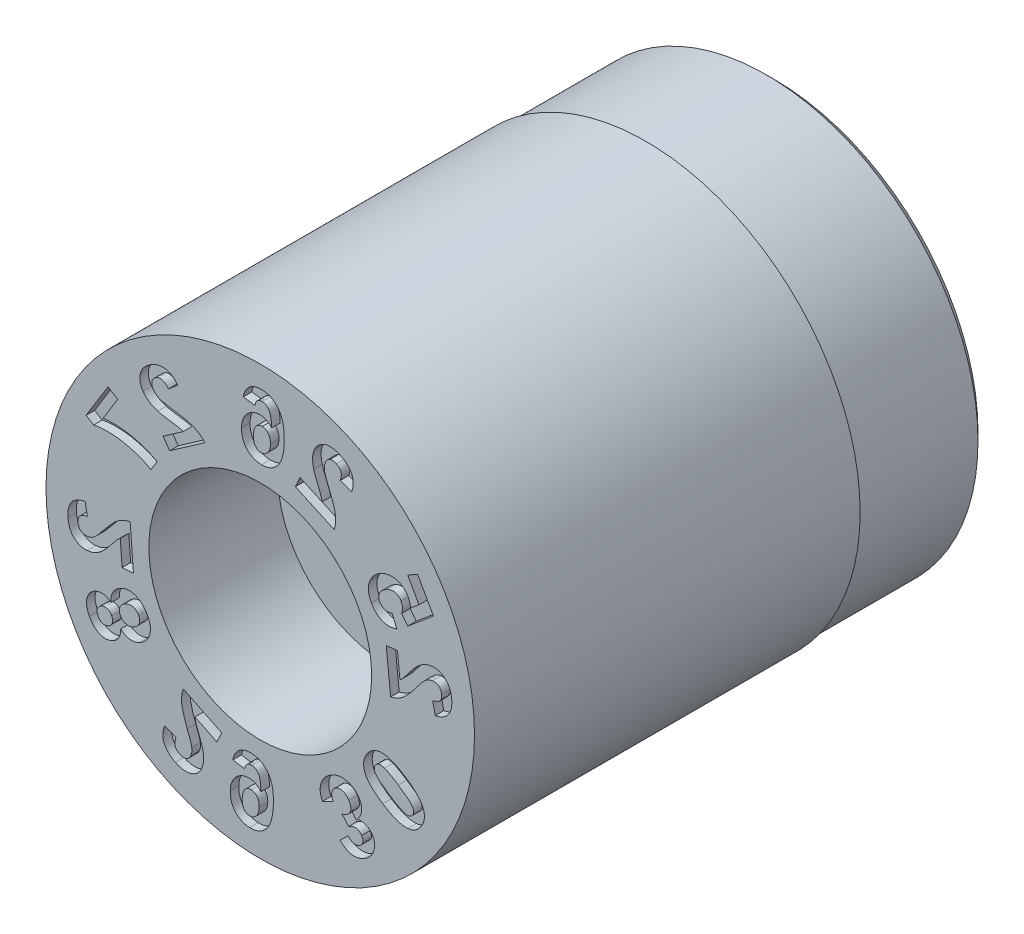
from build123d import *

# Parameters (mm, degrees)
SKETCH4_W          = 3
SKETCH4_H          = 1
CUT_EXTRUDE1_DEPTH = 0.2


with BuildPart() as part:
    # Sketch1 → Revolve1 (revolve)
    with BuildSketch(Plane(origin=(0, 0, 0), x_dir=(0, 0, -1), z_dir=(1, 0, 0)), mode=Mode.PRIVATE) as revolve1_sk:
        Polygon((0, 5), (0, 2.6), (3, 2.6), (3, 1.25), (12, 1.25), (12, 4.75), (11.75, 5), align=None)
    revolve(revolve1_sk.sketch.rotate(Axis((0, 0, 3.797909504), (0, 0, -1)), 90), axis=Axis((0, 0, 3.797909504), (0, 0, -1)))

    # Sketch4 → Cut-Revolve1 (revolve, cut)
    with BuildSketch(Plane(origin=(0, 0, 0), x_dir=(0, 0, -1), z_dir=(1, 0, 0)), mode=Mode.PRIVATE) as cut_revolve1_sk:
        with Locations((10.5, 5.435)):
            Rectangle(SKETCH4_W, SKETCH4_H)
    revolve(cut_revolve1_sk.sketch.rotate(Axis((0, 0, 0), (0, 0, -1)), 90), axis=Axis((0, 0, 0), (0, 0, -1)), mode=Mode.SUBTRACT)

    # Sketch5 → Cut-Extrude1 (cut)
    # profile 1 of 12: a face of its own
    with BuildSketch(Plane.XY):
        with BuildLine():
            Line((3.202094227, 0.808303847), (2.939808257, 0.780935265))
            Line((2.939808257, 0.780935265), (3.042892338, -0.208452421))
            add(Edge.make_bspline(
                [(3.042892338, -0.208452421), (3.067059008, -0.202424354), (3.115404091, -0.190365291), (3.185106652, -0.162492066), (3.251790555, -0.126673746), (3.305441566, -0.090557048), (3.348155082, -0.055835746), (3.382780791, -0.024616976), (3.419199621, 0.012261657), (3.458412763, 0.053775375), (3.499366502, 0.100877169), (3.542462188, 0.153145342), (3.588314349, 0.210130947), (3.618796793, 0.250533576), (3.634579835, 0.271453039)],
                knots=[0, 0, 0, 0, 1.148210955, 2.296979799, 3.452339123, 4.635806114, 5.274468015, 5.99101438, 6.785740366, 7.665235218, 8.625571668, 9.664891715, 10.790939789, 12, 12, 12, 12], degree=3))
            add(Edge.make_bspline(
                [(3.634579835, 0.271453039), (3.647268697, 0.288035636), (3.671484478, 0.319682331), (3.706049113, 0.364727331), (3.737714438, 0.404617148), (3.766256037, 0.4395451), (3.791900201, 0.469396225), (3.814131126, 0.494560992), (3.833649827, 0.514378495), (3.845902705, 0.525609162), (3.851335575, 0.530588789)],
                knots=[0, 0, 0, 0, 1.48154818, 2.827428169, 4.028531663, 5.095135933, 6.027610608, 6.820769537, 7.477134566, 8, 8, 8, 8], degree=3))
            add(Edge.make_bspline(
                [(3.851335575, 0.530588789), (3.864713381, 0.541039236), (3.890475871, 0.561164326), (3.932523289, 0.58362087), (3.974669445, 0.600177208), (4.003743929, 0.604541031), (4.018052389, 0.606688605)],
                knots=[0, 0, 0, 0, 1.094132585, 2.107040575, 3.068415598, 4, 4, 4, 4], degree=3))
            add(Edge.make_bspline(
                [(4.018052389, 0.606688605), (4.033001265, 0.607692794), (4.061348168, 0.609596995), (4.102028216, 0.604097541), (4.138054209, 0.59184266), (4.169069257, 0.572327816), (4.194860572, 0.54648454), (4.214324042, 0.514616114), (4.228158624, 0.477450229), (4.231969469, 0.450562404), (4.233971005, 0.43644036)],
                knots=[0, 0, 0, 0, 1.149882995, 2.180473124, 3.134249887, 4.05488483, 4.973584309, 5.916632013, 6.905771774, 8, 8, 8, 8], degree=3))
            add(Edge.make_bspline(
                [(4.233971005, 0.43644036), (4.234780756, 0.422367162), (4.23633695, 0.395321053), (4.23017529, 0.356052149), (4.216802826, 0.320520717), (4.19928449, 0.294531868), (4.181870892, 0.276062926), (4.166252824, 0.263306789), (4.148458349, 0.251595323), (4.128172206, 0.241228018), (4.10564863, 0.2320353), (4.080842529, 0.223698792), (4.053644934, 0.216881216), (4.034638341, 0.213295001), (4.024794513, 0.211437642)],
                knots=[0, 0, 0, 0, 1.461197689, 2.808154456, 4.095431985, 5.375751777, 6.033842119, 6.727339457, 7.465457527, 8.243007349, 9.089939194, 9.990826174, 10.959415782, 12, 12, 12, 12], degree=3))
            Line((4.024794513, 0.211437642), (4.082250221, -0.066951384))
            add(Edge.make_bspline(
                [(4.082250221, -0.066951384), (4.100813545, -0.062660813), (4.13676832, -0.054350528), (4.187791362, -0.037309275), (4.234610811, -0.017870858), (4.276988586, 0.004654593), (4.31460618, 0.030553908), (4.348008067, 0.059051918), (4.376867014, 0.090671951), (4.401170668, 0.125256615), (4.421136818, 0.162139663), (4.438267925, 0.200602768), (4.451584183, 0.240987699), (4.461336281, 0.283104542), (4.468486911, 0.326834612), (4.471128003, 0.372328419), (4.471406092, 0.419593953), (4.468600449, 0.45151936), (4.467166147, 0.467840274)],
                knots=[0, 0, 0, 0, 1.239571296, 2.40089037, 3.496674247, 4.536428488, 5.51838614, 6.463823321, 7.388463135, 8.297221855, 9.208036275, 10.114476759, 11.034762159, 11.970982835, 12.92634872, 13.915036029, 14.934124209, 16, 16, 16, 16], degree=3))
            add(Edge.make_bspline(
                [(4.467166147, 0.467840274), (4.464978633, 0.485482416), (4.460707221, 0.51993103), (4.449858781, 0.569606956), (4.436061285, 0.616165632), (4.418229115, 0.659222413), (4.397770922, 0.699386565), (4.373447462, 0.736041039), (4.345378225, 0.768953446), (4.314758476, 0.79881454), (4.281367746, 0.824451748), (4.246592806, 0.846553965), (4.210396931, 0.864563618), (4.172876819, 0.878765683), (4.13368793, 0.888389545), (4.093193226, 0.893875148), (4.051291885, 0.895916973), (4.023136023, 0.893600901), (4.008793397, 0.892421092)],
                knots=[0, 0, 0, 0, 1.214768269, 2.371995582, 3.471762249, 4.530075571, 5.553432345, 6.549037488, 7.529432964, 8.505610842, 9.467417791, 10.402003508, 11.318478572, 12.226498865, 13.139128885, 14.070473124, 15.017096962, 16, 16, 16, 16], degree=3))
            add(Edge.make_bspline(
                [(4.008793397, 0.892421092), (3.992483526, 0.890213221), (3.96007923, 0.885826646), (3.912504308, 0.874296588), (3.866668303, 0.858150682), (3.821987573, 0.83763524), (3.778333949, 0.81181216), (3.734332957, 0.781215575), (3.690010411, 0.745156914), (3.661443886, 0.718092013), (3.646701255, 0.704124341)],
                knots=[0, 0, 0, 0, 0.947920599, 1.883319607, 2.814650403, 3.744262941, 4.71154026, 5.733080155, 6.83008644, 8, 8, 8, 8], degree=3))
            add(Edge.make_bspline(
                [(3.646701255, 0.704124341), (3.641436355, 0.69885966), (3.63011923, 0.687543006), (3.612775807, 0.668901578), (3.593681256, 0.647743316), (3.573718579, 0.623312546), (3.551710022, 0.596428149), (3.528340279, 0.566673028), (3.5032567, 0.534345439), (3.477830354, 0.49990578), (3.452357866, 0.465962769), (3.428710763, 0.434277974), (3.407222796, 0.406012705), (3.387858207, 0.381202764), (3.371061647, 0.359395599), (3.356063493, 0.341303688), (3.343575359, 0.326355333), (3.324756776, 0.30469592), (3.298365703, 0.277473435), (3.272676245, 0.25728222), (3.260408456, 0.247640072)],
                knots=[0, 0, 0, 0, 0.670688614, 1.441673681, 2.293482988, 3.237635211, 4.283261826, 5.42353065, 6.645916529, 7.969236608, 9.279821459, 10.469020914, 11.530911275, 12.478291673, 13.304334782, 14.010329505, 14.595161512, 15.058951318, 16.595526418, 18, 18, 18, 18], degree=3))
            Line((3.260408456, 0.247640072), (3.202094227, 0.808303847))
        make_face()
    # profile 2 of 12: a face of its own
    with BuildSketch(Plane.XY):
        with BuildLine():
            Line((3.187592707, 1.240163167), (3.074468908, 1.5017102))
            add(Edge.make_bspline(
                [(3.074468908, 1.5017102), (3.059825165, 1.496368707), (3.031672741, 1.486099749), (2.988213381, 1.4792113), (2.946225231, 1.479532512), (2.906254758, 1.488077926), (2.8698265, 1.503291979), (2.837413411, 1.523749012), (2.810166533, 1.5501583), (2.796668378, 1.571324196), (2.789875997, 1.581975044)],
                knots=[0, 0, 0, 0, 1.151696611, 2.21412313, 3.237833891, 4.243883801, 5.219159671, 6.146287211, 7.06719684, 8, 8, 8, 8], degree=3))
            add(Edge.make_bspline(
                [(2.789875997, 1.581975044), (2.786560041, 1.588428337), (2.779982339, 1.601229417), (2.772437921, 1.6212437), (2.767517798, 1.641688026), (2.764794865, 1.662480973), (2.764846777, 1.683614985), (2.766694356, 1.705183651), (2.771824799, 1.726917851), (2.778443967, 1.749222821), (2.788066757, 1.771462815), (2.80100528, 1.792973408), (2.816573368, 1.814060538), (2.835538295, 1.834180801), (2.856780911, 1.854436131), (2.8813793, 1.873551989), (2.908651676, 1.892407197), (2.928373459, 1.903800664), (2.938580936, 1.909697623)],
                knots=[0, 0, 0, 0, 0.861199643, 1.708319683, 2.532583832, 3.353666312, 4.192140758, 5.038007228, 5.918218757, 6.838506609, 7.799039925, 8.786375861, 9.813740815, 10.905468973, 12.065557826, 13.296247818, 14.60060903, 16, 16, 16, 16], degree=3))
            add(Edge.make_bspline(
                [(2.938580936, 1.909697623), (2.948300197, 1.914874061), (2.967117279, 1.924895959), (2.995391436, 1.937872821), (3.022955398, 1.947835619), (3.049577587, 1.955333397), (3.075293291, 1.959964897), (3.10007544, 1.961438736), (3.123950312, 1.960967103), (3.146805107, 1.957063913), (3.168744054, 1.951407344), (3.189217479, 1.942845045), (3.208826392, 1.933067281), (3.226616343, 1.920472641), (3.243613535, 1.906582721), (3.258721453, 1.889943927), (3.272936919, 1.871682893), (3.280933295, 1.858140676), (3.284991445, 1.851268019)],
                knots=[0, 0, 0, 0, 1.329261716, 2.573531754, 3.751898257, 4.863939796, 5.909294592, 6.898894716, 7.857271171, 8.78463399, 9.691511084, 10.586051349, 11.458750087, 12.330694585, 13.211398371, 14.103319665, 15.037437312, 16, 16, 16, 16], degree=3))
            add(Edge.make_bspline(
                [(3.284991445, 1.851268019), (3.289688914, 1.842328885), (3.29902723, 1.824558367), (3.308825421, 1.796116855), (3.315423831, 1.766884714), (3.319293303, 1.736692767), (3.318622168, 1.705433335), (3.315343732, 1.673264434), (3.308700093, 1.640100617), (3.301724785, 1.618179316), (3.298142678, 1.606921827)],
                knots=[0, 0, 0, 0, 0.958950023, 1.906341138, 2.849126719, 3.805425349, 4.791830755, 5.814125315, 6.877463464, 8, 8, 8, 8], degree=3))
            Line((3.298142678, 1.606921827), (3.440693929, 1.422083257))
            Line((3.440693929, 1.422083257), (4.042168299, 1.928091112))
            Line((4.042168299, 1.928091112), (3.673206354, 2.583718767))
            Line((3.673206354, 2.583718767), (3.441081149, 2.45304965))
            Line((3.441081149, 2.45304965), (3.704306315, 1.9855412))
            Line((3.704306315, 1.9855412), (3.506617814, 1.82302167))
            add(Edge.make_bspline(
                [(3.506617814, 1.82302167), (3.505217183, 1.840351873), (3.502456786, 1.874506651), (3.491406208, 1.924306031), (3.475405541, 1.971801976), (3.46020405, 2.001243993), (3.452648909, 2.015876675)],
                knots=[0, 0, 0, 0, 1.031934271, 2.033760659, 3.02277908, 4, 4, 4, 4], degree=3))
            add(Edge.make_bspline(
                [(3.452648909, 2.015876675), (3.44469227, 2.029137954), (3.428997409, 2.055296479), (3.401193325, 2.091106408), (3.37086493, 2.123462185), (3.337418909, 2.152061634), (3.30085835, 2.176469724), (3.261924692, 2.197918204), (3.219864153, 2.215175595), (3.175390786, 2.228445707), (3.12946562, 2.238277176), (3.08270445, 2.242153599), (3.035821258, 2.242541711), (2.988674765, 2.236863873), (2.941340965, 2.227069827), (2.893903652, 2.211615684), (2.84603268, 2.19218024), (2.815085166, 2.175534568), (2.79935612, 2.167074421)],
                knots=[0, 0, 0, 0, 0.989179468, 1.951205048, 2.895310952, 3.823898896, 4.761012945, 5.704530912, 6.664781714, 7.664645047, 8.672513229, 9.664597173, 10.66297947, 11.668377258, 12.697952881, 13.752204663, 14.857560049, 16, 16, 16, 16], degree=3))
            add(Edge.make_bspline(
                [(2.79935612, 2.167074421), (2.786350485, 2.159398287), (2.760700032, 2.14425898), (2.724714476, 2.11827293), (2.691721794, 2.089795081), (2.660926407, 2.059336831), (2.633254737, 2.02623379), (2.607908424, 1.991112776), (2.585323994, 1.953643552), (2.572801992, 1.927133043), (2.566485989, 1.913761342)],
                knots=[0, 0, 0, 0, 1.034816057, 2.040922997, 3.037497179, 4.019970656, 5.006537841, 5.991239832, 6.986796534, 8, 8, 8, 8], degree=3))
            add(Edge.make_bspline(
                [(2.566485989, 1.913761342), (2.558842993, 1.895420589), (2.543817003, 1.859363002), (2.529954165, 1.803143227), (2.522076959, 1.747100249), (2.522071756, 1.690868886), (2.528858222, 1.634647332), (2.543257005, 1.578479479), (2.56428337, 1.522180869), (2.583255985, 1.486003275), (2.5929433, 1.467531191)],
                knots=[0, 0, 0, 0, 1.02408425, 2.013331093, 2.978530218, 3.938608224, 4.906557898, 5.893465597, 6.924414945, 8, 8, 8, 8], degree=3))
            add(Edge.make_bspline(
                [(2.5929433, 1.467531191), (2.601377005, 1.453097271), (2.617895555, 1.42482649), (2.645973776, 1.385620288), (2.675819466, 1.350056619), (2.707591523, 1.318313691), (2.741287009, 1.290470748), (2.776510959, 1.265916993), (2.813996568, 1.24582342), (2.852848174, 1.229165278), (2.892910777, 1.216348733), (2.933803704, 1.207730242), (2.975142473, 1.203036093), (3.01689438, 1.202510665), (3.059074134, 1.205705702), (3.101673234, 1.213208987), (3.144915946, 1.224126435), (3.173188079, 1.234750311), (3.187592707, 1.240163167)],
                knots=[0, 0, 0, 0, 1.141769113, 2.236308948, 3.290278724, 4.311131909, 5.300294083, 6.273656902, 7.239823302, 8.200910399, 9.158677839, 10.108884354, 11.051966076, 11.996834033, 12.957896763, 13.937781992, 14.949301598, 16, 16, 16, 16], degree=3))
        make_face()
    # profile 3 of 12: a face of its own
    with BuildSketch(Plane.XY):
        with BuildLine():
            Line((0.929178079, 3.169887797), (0.819337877, 2.929741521))
            Line((0.819337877, 2.929741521), (1.725894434, 2.514790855))
            add(Edge.make_bspline(
                [(1.725894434, 2.514790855), (1.73309208, 2.538737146), (1.747456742, 2.586527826), (1.758210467, 2.660976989), (1.762163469, 2.736738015), (1.757797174, 2.80151922), (1.749596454, 2.856137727), (1.740066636, 2.901896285), (1.72713481, 2.952262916), (1.71104475, 3.00714982), (1.690901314, 3.066339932), (1.668497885, 3.130404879), (1.642126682, 3.198807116), (1.622873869, 3.24572784), (1.612918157, 3.269990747)],
                knots=[0, 0, 0, 0, 1.149627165, 2.294362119, 3.452124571, 4.637082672, 5.275377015, 5.993699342, 6.787556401, 7.668633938, 8.625895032, 9.665338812, 10.79273673, 12, 12, 12, 12], degree=3))
            add(Edge.make_bspline(
                [(1.612918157, 3.269990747), (1.605017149, 3.289378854), (1.58995581, 3.326337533), (1.568759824, 3.379205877), (1.550654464, 3.426998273), (1.534792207, 3.469339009), (1.522285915, 3.506684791), (1.51183678, 3.538540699), (1.5045186, 3.565421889), (1.501052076, 3.58168094), (1.499510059, 3.588913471)],
                knots=[0, 0, 0, 0, 1.482747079, 2.826494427, 4.033725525, 5.102235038, 6.028257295, 6.822762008, 7.476327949, 8, 8, 8, 8], degree=3))
            add(Edge.make_bspline(
                [(1.499510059, 3.588913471), (1.497352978, 3.605696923), (1.493177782, 3.638182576), (1.494905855, 3.685917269), (1.502560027, 3.73063144), (1.513333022, 3.757942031), (1.518628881, 3.771367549)],
                knots=[0, 0, 0, 0, 1.090144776, 2.110058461, 3.070930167, 4, 4, 4, 4], degree=3))
            add(Edge.make_bspline(
                [(1.518628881, 3.771367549), (1.525285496, 3.784847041), (1.537916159, 3.810423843), (1.563685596, 3.842633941), (1.592444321, 3.867858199), (1.62546447, 3.884260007), (1.660795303, 3.893128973), (1.698214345, 3.893955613), (1.737282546, 3.886589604), (1.762554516, 3.876208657), (1.775808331, 3.870764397)],
                knots=[0, 0, 0, 0, 1.149046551, 2.180270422, 3.139782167, 4.057583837, 4.977565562, 5.910267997, 6.904045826, 8, 8, 8, 8], degree=3))
            add(Edge.make_bspline(
                [(1.775808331, 3.870764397), (1.788359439, 3.864345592), (1.812516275, 3.851991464), (1.843359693, 3.826734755), (1.867022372, 3.797005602), (1.881097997, 3.76888138), (1.888018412, 3.744435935), (1.891013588, 3.724458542), (1.891969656, 3.703187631), (1.890665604, 3.680452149), (1.887089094, 3.656355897), (1.881404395, 3.630759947), (1.873030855, 3.603861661), (1.866478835, 3.585586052), (1.863087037, 3.576125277)],
                knots=[0, 0, 0, 0, 1.458716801, 2.807559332, 4.096413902, 5.37354086, 6.037972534, 6.723812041, 7.463449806, 8.242019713, 9.081259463, 9.986888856, 10.957868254, 12, 12, 12, 12], degree=3))
            Line((1.863087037, 3.576125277), (2.132632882, 3.483731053))
            add(Edge.make_bspline(
                [(2.132632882, 3.483731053), (2.13828865, 3.501938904), (2.149252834, 3.537236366), (2.160814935, 3.589882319), (2.167694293, 3.640132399), (2.169432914, 3.688072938), (2.167093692, 3.733662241), (2.159401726, 3.776990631), (2.146406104, 3.817812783), (2.129103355, 3.856327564), (2.107632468, 3.892546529), (2.082834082, 3.926691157), (2.054945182, 3.958908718), (2.024107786, 3.989326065), (1.989453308, 4.017082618), (1.951827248, 4.043066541), (1.911131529, 4.067368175), (1.882158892, 4.081288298), (1.8673813, 4.088388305)],
                knots=[0, 0, 0, 0, 1.238629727, 2.401188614, 3.498538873, 4.530214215, 5.51447309, 6.460023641, 7.381403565, 8.29167989, 9.198178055, 10.112819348, 11.030628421, 11.964727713, 12.923627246, 13.911945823, 14.934980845, 16, 16, 16, 16], degree=3))
            add(Edge.make_bspline(
                [(1.8673813, 4.088388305), (1.851000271, 4.095435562), (1.819103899, 4.109157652), (1.77083766, 4.125424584), (1.72361548, 4.136823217), (1.677486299, 4.143702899), (1.632387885, 4.146090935), (1.588454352, 4.143441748), (1.545526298, 4.136659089), (1.504241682, 4.124849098), (1.464814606, 4.109587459), (1.428084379, 4.090596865), (1.394088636, 4.068506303), (1.362907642, 4.043136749), (1.334367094, 4.014641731), (1.309082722, 3.982544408), (1.286132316, 3.947474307), (1.273801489, 3.922017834), (1.267528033, 3.909066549)],
                knots=[0, 0, 0, 0, 1.216717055, 2.369134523, 3.471312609, 4.527882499, 5.548068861, 6.547524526, 7.526478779, 8.508102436, 9.472364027, 10.407472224, 11.32492386, 12.234498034, 13.146227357, 14.071312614, 15.018757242, 16, 16, 16, 16], degree=3))
            add(Edge.make_bspline(
                [(1.267528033, 3.909066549), (1.261079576, 3.893788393), (1.248307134, 3.86352699), (1.234146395, 3.816479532), (1.225004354, 3.768680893), (1.220042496, 3.71976371), (1.219962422, 3.668951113), (1.224204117, 3.615448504), (1.231963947, 3.55867374), (1.240730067, 3.520231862), (1.24525691, 3.500380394)],
                knots=[0, 0, 0, 0, 0.952811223, 1.887230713, 2.817935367, 3.746518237, 4.709555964, 5.73444618, 6.830063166, 8, 8, 8, 8], degree=3))
            add(Edge.make_bspline(
                [(1.24525691, 3.500380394), (1.247057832, 3.493117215), (1.250910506, 3.477579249), (1.258860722, 3.453366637), (1.267260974, 3.42611073), (1.278094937, 3.396387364), (1.290361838, 3.363826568), (1.304206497, 3.328521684), (1.319536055, 3.290542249), (1.335981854, 3.250967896), (1.352382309, 3.211890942), (1.367748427, 3.17543462), (1.380951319, 3.142371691), (1.393038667, 3.113190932), (1.402723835, 3.087317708), (1.411311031, 3.065418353), (1.417564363, 3.046868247), (1.426688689, 3.019472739), (1.43657622, 2.982706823), (1.440688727, 2.950204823), (1.442640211, 2.934781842)],
                knots=[0, 0, 0, 0, 0.672625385, 1.438933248, 2.290373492, 3.236993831, 4.282664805, 5.419176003, 6.646676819, 7.965285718, 9.272527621, 10.457292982, 11.52244553, 12.473681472, 13.296983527, 14.006405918, 14.588394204, 15.056708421, 16.603337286, 18, 18, 18, 18], degree=3))
            Line((1.442640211, 2.934781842), (0.929178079, 3.169887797))
        make_face()
    # profile 4 of 12: a face of its own
    with BuildSketch(Plane.XY):
        with BuildLine():
            Line((-0.397334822, 4.136222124), (-0.122121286, 4.100375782))
            add(Edge.make_bspline(
                [(-0.122121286, 4.100375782), (-0.119857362, 4.11368845), (-0.115572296, 4.138886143), (-0.103683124, 4.17339805), (-0.087773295, 4.202408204), (-0.067491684, 4.225529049), (-0.043811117, 4.243330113), (-0.016933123, 4.255574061), (0.012989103, 4.262795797), (0.033894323, 4.263063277), (0.044785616, 4.26320263)],
                knots=[0, 0, 0, 0, 1.246209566, 2.358776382, 3.35633672, 4.284319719, 5.179076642, 6.073163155, 6.996148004, 8, 8, 8, 8], degree=3))
            add(Edge.make_bspline(
                [(0.044785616, 4.26320263), (0.052199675, 4.262779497), (0.066806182, 4.26194588), (0.088126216, 4.25763122), (0.108533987, 4.25116605), (0.127931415, 4.241771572), (0.146352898, 4.229822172), (0.164039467, 4.215504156), (0.180356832, 4.198302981), (0.196705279, 4.178887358), (0.211208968, 4.154811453), (0.224085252, 4.125801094), (0.235075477, 4.091393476), (0.244921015, 4.051737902), (0.252766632, 4.006454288), (0.259271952, 3.955805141), (0.264639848, 3.899738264), (0.266561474, 3.860552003), (0.267567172, 3.840043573)],
                knots=[0, 0, 0, 0, 0.672066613, 1.324044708, 1.964747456, 2.606990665, 3.2699903, 3.950579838, 4.663089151, 5.415180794, 6.245735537, 7.199424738, 8.284883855, 9.513938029, 10.898807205, 12.44587437, 14.139921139, 16, 16, 16, 16], degree=3))
            add(Edge.make_bspline(
                [(0.267567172, 3.840043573), (0.258868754, 3.850237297), (0.241762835, 3.870283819), (0.212819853, 3.896272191), (0.182581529, 3.918933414), (0.150448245, 3.937474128), (0.116452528, 3.951834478), (0.080864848, 3.962297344), (0.043617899, 3.969100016), (0.018163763, 3.970358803), (0.005241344, 3.970997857)],
                knots=[0, 0, 0, 0, 1.059559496, 2.083682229, 3.070906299, 4.045993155, 5.011852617, 5.984713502, 6.976890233, 8, 8, 8, 8], degree=3))
            add(Edge.make_bspline(
                [(0.005241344, 3.970997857), (-0.009427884, 3.970904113), (-0.03833533, 3.97071938), (-0.080907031, 3.965035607), (-0.121927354, 3.955234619), (-0.161439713, 3.941152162), (-0.19953803, 3.922684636), (-0.235886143, 3.899640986), (-0.270899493, 3.872657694), (-0.303784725, 3.841584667), (-0.334281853, 3.807414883), (-0.36095845, 3.769950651), (-0.383552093, 3.729879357), (-0.402645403, 3.687432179), (-0.417292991, 3.642319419), (-0.428294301, 3.594786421), (-0.435158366, 3.544623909), (-0.436590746, 3.510306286), (-0.437322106, 3.492784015)],
                knots=[0, 0, 0, 0, 0.967248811, 1.906077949, 2.82667566, 3.745967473, 4.668579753, 5.614570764, 6.581006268, 7.581206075, 8.595932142, 9.598705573, 10.609679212, 11.627156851, 12.6648704, 13.734324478, 14.843166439, 16, 16, 16, 16], degree=3))
            add(Edge.make_bspline(
                [(-0.437322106, 3.492784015), (-0.437261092, 3.474215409), (-0.437141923, 3.43794875), (-0.432130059, 3.384756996), (-0.422389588, 3.334376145), (-0.408695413, 3.286684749), (-0.390975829, 3.24157628), (-0.368465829, 3.199457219), (-0.342011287, 3.159860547), (-0.311297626, 3.123537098), (-0.277251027, 3.090769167), (-0.240736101, 3.061601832), (-0.201537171, 3.037099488), (-0.159883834, 3.01694033), (-0.115775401, 3.000997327), (-0.069231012, 2.989190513), (-0.02016851, 2.981707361), (0.013370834, 2.980160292), (0.030493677, 2.979370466)],
                knots=[0, 0, 0, 0, 1.140655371, 2.227833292, 3.277354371, 4.289445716, 5.273083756, 6.249532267, 7.218366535, 8.194213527, 9.166385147, 10.118018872, 11.060834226, 12.000752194, 12.956497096, 13.937898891, 14.947235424, 16, 16, 16, 16], degree=3))
            add(Edge.make_bspline(
                [(0.030493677, 2.979370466), (0.048885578, 2.979515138), (0.084995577, 2.979799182), (0.138032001, 2.987272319), (0.188647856, 2.999793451), (0.236797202, 3.018261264), (0.282529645, 3.042175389), (0.326026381, 3.071426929), (0.366688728, 3.10669493), (0.405259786, 3.146957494), (0.440745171, 3.193692), (0.47088281, 3.248029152), (0.497279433, 3.309064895), (0.518688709, 3.377267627), (0.535710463, 3.452428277), (0.548425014, 3.534500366), (0.557283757, 3.623603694), (0.559274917, 3.685433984), (0.560306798, 3.717476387)],
                knots=[0, 0, 0, 0, 0.859536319, 1.687582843, 2.498486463, 3.293921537, 4.093540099, 4.90784726, 5.739913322, 6.606405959, 7.512233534, 8.476103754, 9.505400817, 10.618152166, 11.814554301, 13.107000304, 14.500756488, 16, 16, 16, 16], degree=3))
            add(Edge.make_bspline(
                [(0.560306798, 3.717476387), (0.560507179, 3.750370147), (0.560893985, 3.813866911), (0.555510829, 3.905656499), (0.545810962, 3.990530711), (0.530561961, 4.068308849), (0.51122688, 4.13933532), (0.486521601, 4.203202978), (0.456844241, 4.260092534), (0.42227812, 4.30990818), (0.383661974, 4.35324609), (0.342070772, 4.39085586), (0.297670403, 4.423056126), (0.250234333, 4.44961841), (0.199687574, 4.470175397), (0.146366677, 4.485814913), (0.09001151, 4.495354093), (0.051405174, 4.497107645), (0.031774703, 4.497999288)],
                knots=[0, 0, 0, 0, 1.479203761, 2.855394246, 4.132997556, 5.31858156, 6.417012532, 7.439819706, 8.39256249, 9.296284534, 10.159717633, 10.997828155, 11.813741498, 12.621655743, 13.436859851, 14.262896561, 15.116721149, 16, 16, 16, 16], degree=3))
            add(Edge.make_bspline(
                [(0.031774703, 4.497999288), (0.017926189, 4.497953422), (-0.009156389, 4.497863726), (-0.048983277, 4.494461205), (-0.086932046, 4.487440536), (-0.123153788, 4.477846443), (-0.157734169, 4.465458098), (-0.190241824, 4.449432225), (-0.221298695, 4.430821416), (-0.250417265, 4.409173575), (-0.277402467, 4.384578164), (-0.302061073, 4.357156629), (-0.324330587, 4.327050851), (-0.344150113, 4.29425389), (-0.361151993, 4.258614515), (-0.37599513, 4.220344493), (-0.388145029, 4.179265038), (-0.39422898, 4.150769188), (-0.397334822, 4.136222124)],
                knots=[0, 0, 0, 0, 1.075023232, 2.10234845, 3.098559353, 4.067720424, 5.009343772, 5.945330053, 6.877139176, 7.817219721, 8.757589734, 9.707526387, 10.676031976, 11.661039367, 12.678128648, 13.738109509, 14.845310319, 16, 16, 16, 16], degree=3))
        make_face()
        with BuildLine():
            add(Edge.make_bspline(
                [(0.23637588, 3.501788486), (0.2359863, 3.490571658), (0.235226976, 3.468709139), (0.231347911, 3.43693771), (0.226190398, 3.407141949), (0.218609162, 3.379400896), (0.209290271, 3.353644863), (0.197706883, 3.329840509), (0.184216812, 3.308118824), (0.168941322, 3.288527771), (0.15237945, 3.271301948), (0.135097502, 3.256294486), (0.11757732, 3.243269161), (0.099131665, 3.233225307), (0.080376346, 3.224976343), (0.060867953, 3.219709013), (0.041021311, 3.215883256), (0.027602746, 3.215850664), (0.020858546, 3.215834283)],
                knots=[0, 0, 0, 0, 1.351555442, 2.634292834, 3.852758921, 4.991475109, 6.094333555, 7.148037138, 8.174794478, 9.169350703, 10.135387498, 11.048738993, 11.925070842, 12.759090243, 13.574125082, 14.386923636, 15.189264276, 16, 16, 16, 16], degree=3))
            add(Edge.make_bspline(
                [(0.020858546, 3.215834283), (0.00807247, 3.216726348), (-0.016934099, 3.21847102), (-0.052181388, 3.231757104), (-0.083703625, 3.252234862), (-0.106595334, 3.275176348), (-0.122264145, 3.29750606), (-0.132585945, 3.317050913), (-0.141350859, 3.33897683), (-0.148417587, 3.363327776), (-0.153627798, 3.390116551), (-0.156697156, 3.419338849), (-0.158943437, 3.450915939), (-0.158714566, 3.472827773), (-0.158596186, 3.484161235)],
                knots=[0, 0, 0, 0, 1.26185763, 2.467897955, 3.675726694, 4.958405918, 5.643873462, 6.367565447, 7.138965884, 7.975298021, 8.871433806, 9.83387339, 10.879614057, 12, 12, 12, 12], degree=3))
            add(Edge.make_bspline(
                [(-0.158596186, 3.484161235), (-0.158117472, 3.495870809), (-0.157192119, 3.518505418), (-0.154277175, 3.551158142), (-0.149052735, 3.581278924), (-0.142329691, 3.608981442), (-0.133821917, 3.634325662), (-0.123590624, 3.657214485), (-0.111645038, 3.677670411), (-0.097848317, 3.695586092), (-0.082852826, 3.71106635), (-0.067019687, 3.724569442), (-0.050334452, 3.735896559), (-0.032792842, 3.745289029), (-0.014203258, 3.751951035), (0.005083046, 3.757029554), (0.025297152, 3.75981918), (0.039052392, 3.75996228), (0.045985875, 3.760034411)],
                knots=[0, 0, 0, 0, 1.453728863, 2.81005821, 4.062970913, 5.242324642, 6.343145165, 7.374460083, 8.34723402, 9.274510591, 10.172181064, 11.016321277, 11.85126779, 12.669594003, 13.477191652, 14.294762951, 15.140456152, 16, 16, 16, 16], degree=3))
            add(Edge.make_bspline(
                [(0.045985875, 3.760034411), (0.059278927, 3.759150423), (0.085307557, 3.757419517), (0.122162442, 3.743565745), (0.155754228, 3.722609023), (0.180125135, 3.698623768), (0.196935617, 3.675764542), (0.208347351, 3.656557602), (0.217615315, 3.635329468), (0.225156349, 3.612272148), (0.230730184, 3.587263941), (0.234250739, 3.560336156), (0.236550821, 3.531637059), (0.236435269, 3.511921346), (0.23637588, 3.501788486)],
                knots=[0, 0, 0, 0, 1.323508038, 2.591511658, 3.881205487, 5.254529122, 5.972781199, 6.710462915, 7.479523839, 8.279920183, 9.128743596, 10.032823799, 10.988972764, 12, 12, 12, 12], degree=3))
        make_face(mode=Mode.SUBTRACT)
    # profile 5 of 12: a face of its own
    with BuildSketch(Plane.XY):
        with BuildLine():
            Line((-2.266613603, 2.407274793), (-2.114450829, 2.189209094))
            Line((-2.114450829, 2.189209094), (-1.291184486, 2.76307005))
            add(Edge.make_bspline(
                [(-1.291184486, 2.76307005), (-1.308399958, 2.781470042), (-1.342747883, 2.818181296), (-1.401299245, 2.866391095), (-1.465510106, 2.907740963), (-1.523598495, 2.937683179), (-1.57497571, 2.958750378), (-1.619723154, 2.973622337), (-1.669871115, 2.988321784), (-1.725904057, 3.001947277), (-1.787391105, 3.015321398), (-1.854632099, 3.028159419), (-1.927459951, 3.040228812), (-1.978014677, 3.047500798), (-2.004147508, 3.051259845)],
                knots=[0, 0, 0, 0, 1.150765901, 2.295982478, 3.455384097, 4.635850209, 5.277144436, 5.991508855, 6.789930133, 7.664999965, 8.626382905, 9.665694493, 10.793346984, 12, 12, 12, 12], degree=3))
            add(Edge.make_bspline(
                [(-2.004147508, 3.051259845), (-2.025004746, 3.05430215), (-2.064658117, 3.06008612), (-2.121151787, 3.069066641), (-2.171846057, 3.077388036), (-2.21666455, 3.085464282), (-2.25552619, 3.093685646), (-2.288445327, 3.101406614), (-2.315759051, 3.108051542), (-2.331575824, 3.113662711), (-2.338567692, 3.116143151)],
                knots=[0, 0, 0, 0, 1.483204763, 2.819839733, 4.025211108, 5.098192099, 6.024180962, 6.819712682, 7.478249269, 8, 8, 8, 8], degree=3))
            add(Edge.make_bspline(
                [(-2.338567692, 3.116143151), (-2.354271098, 3.122933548), (-2.38456383, 3.136032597), (-2.425228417, 3.161749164), (-2.460165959, 3.191271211), (-2.478302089, 3.214728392), (-2.487244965, 3.226295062)],
                knots=[0, 0, 0, 0, 1.092793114, 2.10805773, 3.067088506, 4, 4, 4, 4], degree=3))
            add(Edge.make_bspline(
                [(-2.487244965, 3.226295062), (-2.495414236, 3.239021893), (-2.510880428, 3.263116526), (-2.52600883, 3.301701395), (-2.532546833, 3.33961585), (-2.530327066, 3.376609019), (-2.5200197, 3.411823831), (-2.50139707, 3.444355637), (-2.475674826, 3.474771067), (-2.453722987, 3.491213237), (-2.442224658, 3.499825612)],
                knots=[0, 0, 0, 0, 1.151875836, 2.18074919, 3.139165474, 4.06522025, 4.984405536, 5.912980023, 6.906823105, 8, 8, 8, 8], degree=3))
            add(Edge.make_bspline(
                [(-2.442224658, 3.499825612), (-2.430222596, 3.507548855), (-2.407191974, 3.522368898), (-2.369360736, 3.535924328), (-2.33144415, 3.541346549), (-2.299780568, 3.539097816), (-2.274922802, 3.532506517), (-2.256200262, 3.524769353), (-2.237118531, 3.514970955), (-2.218182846, 3.501956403), (-2.198887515, 3.48656423), (-2.179701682, 3.468408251), (-2.15999499, 3.44806997), (-2.147624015, 3.432985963), (-2.14119259, 3.425144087)],
                knots=[0, 0, 0, 0, 1.463881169, 2.809025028, 4.094689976, 5.379323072, 6.041402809, 6.731798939, 7.45872194, 8.243133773, 9.089977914, 9.99478166, 10.957526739, 12, 12, 12, 12], degree=3))
            Line((-2.14119259, 3.425144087), (-1.923680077, 3.611452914))
            add(Edge.make_bspline(
                [(-1.923680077, 3.611452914), (-1.93651308, 3.625769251), (-1.961370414, 3.65349978), (-2.001272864, 3.690247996), (-2.041286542, 3.721900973), (-2.081783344, 3.748158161), (-2.122717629, 3.769285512), (-2.164285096, 3.784579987), (-2.206289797, 3.794622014), (-2.248626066, 3.799232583), (-2.290987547, 3.798789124), (-2.333318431, 3.795317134), (-2.375397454, 3.787058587), (-2.417542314, 3.775744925), (-2.459496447, 3.760261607), (-2.50125709, 3.740907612), (-2.542947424, 3.717687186), (-2.569885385, 3.699728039), (-2.583640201, 3.690557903)],
                knots=[0, 0, 0, 0, 1.240116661, 2.402087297, 3.495671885, 4.529072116, 5.511997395, 6.462157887, 7.380136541, 8.292522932, 9.202616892, 10.110504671, 11.029461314, 11.965690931, 12.924082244, 13.911312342, 14.933493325, 16, 16, 16, 16], degree=3))
            add(Edge.make_bspline(
                [(-2.583640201, 3.690557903), (-2.598121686, 3.680037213), (-2.626461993, 3.659448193), (-2.665040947, 3.625615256), (-2.699439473, 3.590640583), (-2.728922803, 3.554077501), (-2.753947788, 3.516235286), (-2.774295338, 3.476922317), (-2.789881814, 3.436174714), (-2.80105827, 3.394484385), (-2.807880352, 3.352587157), (-2.810402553, 3.310988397), (-2.808368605, 3.270053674), (-2.80231567, 3.229904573), (-2.792058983, 3.190548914), (-2.776850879, 3.152302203), (-2.7583329, 3.114323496), (-2.742502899, 3.090547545), (-2.734456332, 3.078461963)],
                knots=[0, 0, 0, 0, 1.212255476, 2.372387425, 3.472114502, 4.532266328, 5.549588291, 6.541165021, 7.525282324, 8.499735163, 9.460671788, 10.396699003, 11.318097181, 12.232344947, 13.143565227, 14.066711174, 15.017287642, 16, 16, 16, 16], degree=3))
            add(Edge.make_bspline(
                [(-2.734456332, 3.078461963), (-2.724644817, 3.065036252), (-2.705152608, 3.038363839), (-2.671369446, 3.002363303), (-2.634733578, 2.969906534), (-2.594976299, 2.940592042), (-2.550923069, 2.914536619), (-2.502402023, 2.890783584), (-2.449099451, 2.868750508), (-2.411378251, 2.856699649), (-2.391899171, 2.850476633)],
                knots=[0, 0, 0, 0, 0.949893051, 1.887120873, 2.815385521, 3.745044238, 4.706345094, 5.737036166, 6.831414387, 8, 8, 8, 8], degree=3))
            add(Edge.make_bspline(
                [(-2.391899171, 2.850476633), (-2.384651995, 2.848409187), (-2.369171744, 2.843993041), (-2.344244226, 2.837713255), (-2.31618462, 2.83157203), (-2.284884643, 2.825566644), (-2.250370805, 2.819675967), (-2.212728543, 2.813346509), (-2.171834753, 2.807471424), (-2.129058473, 2.801309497), (-2.08673921, 2.795407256), (-2.047263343, 2.789885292), (-2.011782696, 2.784877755), (-1.980371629, 2.780018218), (-1.953012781, 2.775437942), (-1.929773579, 2.771250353), (-1.910362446, 2.76787164), (-1.882048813, 2.761435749), (-1.845012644, 2.751416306), (-1.814581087, 2.738553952), (-1.800078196, 2.732424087)],
                knots=[0, 0, 0, 0, 0.672720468, 1.436957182, 2.294271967, 3.236481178, 4.281703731, 5.419747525, 6.643723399, 7.969471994, 9.277739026, 10.457990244, 11.527706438, 12.476341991, 13.295265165, 14.003810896, 14.584428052, 15.053555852, 16.595801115, 18, 18, 18, 18], degree=3))
            Line((-1.800078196, 2.732424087), (-2.266613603, 2.407274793))
        make_face()
    # profile 6 of 12: a face of its own
    with BuildSketch(Plane.XY):
        with BuildLine():
            Line((-3.326534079, 2.622747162), (-3.552197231, 2.761679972))
            Line((-3.552197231, 2.761679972), (-4.064345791, 1.930975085))
            Line((-4.064345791, 1.930975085), (-3.888172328, 1.822349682))
            add(Edge.make_bspline(
                [(-3.888172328, 1.822349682), (-3.873962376, 1.8256088), (-3.844834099, 1.832289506), (-3.799272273, 1.83967542), (-3.75109261, 1.845711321), (-3.700013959, 1.850456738), (-3.646129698, 1.853076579), (-3.589407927, 1.854895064), (-3.529901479, 1.854042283), (-3.446886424, 1.852154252), (-3.341486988, 1.844507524), (-3.215362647, 1.826661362), (-3.090015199, 1.801457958), (-2.987124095, 1.773225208), (-2.906569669, 1.747263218), (-2.848370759, 1.727158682), (-2.792668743, 1.706023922), (-2.739637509, 1.683873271), (-2.688945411, 1.661221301), (-2.641122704, 1.63702638), (-2.595221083, 1.612764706), (-2.56618244, 1.595044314), (-2.551877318, 1.58631483)],
                knots=[0, 0, 0, 0, 0.631032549, 1.293522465, 1.997086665, 2.733083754, 3.513726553, 4.332369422, 5.189554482, 6.089721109, 7.927336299, 9.760438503, 11.601197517, 13.459023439, 14.375871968, 15.265162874, 16.124495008, 16.954644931, 17.753101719, 18.52756578, 19.274644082, 20, 20, 20, 20], degree=3))
            Line((-2.551877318, 1.58631483), (-2.407445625, 1.820450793))
            add(Edge.make_bspline(
                [(-2.407445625, 1.820450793), (-2.429876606, 1.833222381), (-2.474941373, 1.858881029), (-2.544933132, 1.893643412), (-2.617226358, 1.925270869), (-2.69134555, 1.9548202), (-2.767985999, 1.980919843), (-2.846592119, 2.004652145), (-2.927465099, 2.025370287), (-3.009974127, 2.043155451), (-3.093412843, 2.057924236), (-3.176855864, 2.069465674), (-3.259773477, 2.078035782), (-3.342175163, 2.083283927), (-3.424083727, 2.084697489), (-3.505576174, 2.083728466), (-3.586605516, 2.07916221), (-3.640265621, 2.073331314), (-3.66702766, 2.070423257)],
                knots=[0, 0, 0, 0, 0.948909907, 1.906399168, 2.87159804, 3.849638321, 4.83922359, 5.847389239, 6.867988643, 7.907833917, 8.950030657, 9.982763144, 11.004371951, 12.014338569, 13.017548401, 14.015675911, 15.010353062, 16, 16, 16, 16], degree=3))
            Line((-3.66702766, 2.070423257), (-3.326534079, 2.622747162))
        make_face()
    # profile 7 of 12: a face of its own
    with BuildSketch(Plane.XY):
        with BuildLine():
            Line((-3.224162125, -0.726792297), (-2.959474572, -0.706485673))
            Line((-2.959474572, -0.706485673), (-3.035844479, 0.292518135))
            add(Edge.make_bspline(
                [(-3.035844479, 0.292518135), (-3.06041944, 0.287121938), (-3.10946026, 0.276353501), (-3.18051798, 0.250122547), (-3.248826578, 0.216118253), (-3.303974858, 0.181225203), (-3.347954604, 0.147497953), (-3.383383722, 0.116608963), (-3.421207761, 0.080697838), (-3.461665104, 0.039850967), (-3.50390172, -0.006647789), (-3.548963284, -0.057819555), (-3.59650668, -0.114124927), (-3.628338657, -0.153887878), (-3.64486595, -0.174532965)],
                knots=[0, 0, 0, 0, 1.151074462, 2.297038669, 3.457450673, 4.640324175, 5.278715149, 5.993882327, 6.79160326, 7.666725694, 8.625856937, 9.66764525, 10.789031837, 12, 12, 12, 12], degree=3))
            add(Edge.make_bspline(
                [(-3.64486595, -0.174532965), (-3.658050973, -0.190948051), (-3.683138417, -0.222181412), (-3.719220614, -0.266533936), (-3.752529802, -0.30549033), (-3.782263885, -0.33989768), (-3.808467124, -0.369588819), (-3.832014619, -0.393709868), (-3.851700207, -0.413580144), (-3.86445596, -0.424417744), (-3.870154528, -0.429259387)],
                knots=[0, 0, 0, 0, 1.484169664, 2.823963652, 4.030127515, 5.096895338, 6.029824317, 6.820615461, 7.473115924, 8, 8, 8, 8], degree=3))
            add(Edge.make_bspline(
                [(-3.870154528, -0.429259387), (-3.883905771, -0.439418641), (-3.910417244, -0.459005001), (-3.953282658, -0.480637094), (-3.996215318, -0.496001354), (-4.025554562, -0.499594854), (-4.040010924, -0.501365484)],
                knots=[0, 0, 0, 0, 1.094384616, 2.109900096, 3.068688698, 4, 4, 4, 4], degree=3))
            add(Edge.make_bspline(
                [(-4.040010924, -0.501365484), (-4.055120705, -0.501994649), (-4.083745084, -0.503186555), (-4.124524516, -0.496270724), (-4.160688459, -0.483308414), (-4.191283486, -0.462452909), (-4.216382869, -0.435780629), (-4.235197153, -0.403324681), (-4.24763328, -0.365490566), (-4.250805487, -0.338291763), (-4.25246787, -0.324038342)],
                knots=[0, 0, 0, 0, 1.152081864, 2.182535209, 3.137976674, 4.06365189, 4.982347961, 5.912720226, 6.906169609, 8, 8, 8, 8], degree=3))
            add(Edge.make_bspline(
                [(-4.25246787, -0.324038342), (-4.252949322, -0.309816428), (-4.253873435, -0.282518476), (-4.246425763, -0.243152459), (-4.232255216, -0.207770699), (-4.214167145, -0.181875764), (-4.195996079, -0.163842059), (-4.179937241, -0.151387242), (-4.161517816, -0.140287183), (-4.140723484, -0.130639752), (-4.117798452, -0.121534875), (-4.092474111, -0.114141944), (-4.064835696, -0.108224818), (-4.045638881, -0.105071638), (-4.035653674, -0.103431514)],
                knots=[0, 0, 0, 0, 1.462974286, 2.808075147, 4.095159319, 5.365618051, 6.030479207, 6.728341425, 7.454931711, 8.241998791, 9.088495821, 9.995111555, 10.957159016, 12, 12, 12, 12], degree=3))
            Line((-4.035653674, -0.103431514), (-4.085613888, 0.17831437))
            add(Edge.make_bspline(
                [(-4.085613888, 0.17831437), (-4.104419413, 0.174551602), (-4.140887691, 0.167254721), (-4.192743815, 0.151547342), (-4.240389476, 0.133286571), (-4.283483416, 0.111476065), (-4.322285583, 0.086641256), (-4.356855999, 0.058961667), (-4.386943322, 0.028008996), (-4.412159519, -0.006164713), (-4.433232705, -0.042864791), (-4.451532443, -0.08109783), (-4.466132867, -0.121342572), (-4.477401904, -0.163336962), (-4.485269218, -0.207256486), (-4.489864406, -0.252958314), (-4.490786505, -0.300493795), (-4.489054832, -0.332638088), (-4.488171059, -0.349043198)],
                knots=[0, 0, 0, 0, 1.239119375, 2.402940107, 3.49780817, 4.533852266, 5.51931563, 6.471018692, 7.390458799, 8.301562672, 9.208608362, 10.122675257, 11.038345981, 11.971881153, 12.930147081, 13.919495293, 14.938196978, 16, 16, 16, 16], degree=3))
            add(Edge.make_bspline(
                [(-4.488171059, -0.349043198), (-4.486440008, -0.366909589), (-4.483065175, -0.401741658), (-4.473467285, -0.452125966), (-4.460622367, -0.499294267), (-4.444223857, -0.543213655), (-4.424363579, -0.583905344), (-4.400861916, -0.621337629), (-4.374144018, -0.655733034), (-4.343721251, -0.686266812), (-4.311219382, -0.713540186), (-4.276593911, -0.73652094), (-4.240545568, -0.755679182), (-4.202988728, -0.770616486), (-4.163903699, -0.781467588), (-4.123369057, -0.788458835), (-4.081261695, -0.791246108), (-4.052811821, -0.789732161), (-4.038398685, -0.788965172)],
                knots=[0, 0, 0, 0, 1.218051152, 2.374695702, 3.477021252, 4.533209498, 5.552553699, 6.545382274, 7.528782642, 8.502616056, 9.465948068, 10.404508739, 11.318385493, 12.232666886, 13.142614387, 14.067204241, 15.020816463, 16, 16, 16, 16], degree=3))
            add(Edge.make_bspline(
                [(-4.038398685, -0.788965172), (-4.021840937, -0.787267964), (-3.989101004, -0.783912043), (-3.941000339, -0.773390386), (-3.894557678, -0.758364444), (-3.849222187, -0.738784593), (-3.804327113, -0.714336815), (-3.75936277, -0.684381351), (-3.713477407, -0.649417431), (-3.683820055, -0.623060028), (-3.668507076, -0.609450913)],
                knots=[0, 0, 0, 0, 0.951613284, 1.881641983, 2.810469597, 3.74025114, 4.70270546, 5.730823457, 6.828356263, 8, 8, 8, 8], degree=3))
            add(Edge.make_bspline(
                [(-3.668507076, -0.609450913), (-3.663082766, -0.604306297), (-3.651480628, -0.593302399), (-3.633682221, -0.574970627), (-3.613975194, -0.554148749), (-3.59323864, -0.530122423), (-3.570285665, -0.503866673), (-3.545910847, -0.474662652), (-3.52032536, -0.442374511), (-3.493357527, -0.408673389), (-3.467010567, -0.375115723), (-3.442283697, -0.3438841), (-3.419671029, -0.316124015), (-3.399565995, -0.291517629), (-3.38171327, -0.270284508), (-3.366643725, -0.252068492), (-3.353746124, -0.237265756), (-3.333757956, -0.216213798), (-3.306215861, -0.189755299), (-3.279845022, -0.17006687), (-3.26733184, -0.160724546)],
                knots=[0, 0, 0, 0, 0.6690037, 1.430942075, 2.28633321, 3.234356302, 4.270811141, 5.407541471, 6.638253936, 7.957634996, 9.270452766, 10.456580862, 11.522654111, 12.474779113, 13.3003418, 14.005312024, 14.590653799, 15.056866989, 16.603458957, 18, 18, 18, 18], degree=3))
            Line((-3.26733184, -0.160724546), (-3.224162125, -0.726792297))
        make_face()
    # profile 8 of 12: a face of its own
    with BuildSketch(Plane.XY):
        with BuildLine():
            add(Edge.make_bspline(
                [(-3.483211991, -1.562602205), (-3.490961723, -1.556556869), (-3.506135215, -1.544720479), (-3.529372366, -1.528539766), (-3.552956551, -1.515006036), (-3.57657034, -1.503345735), (-3.600433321, -1.494370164), (-3.624270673, -1.487013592), (-3.648280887, -1.482224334), (-3.680130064, -1.478777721), (-3.719656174, -1.478616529), (-3.766253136, -1.485413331), (-3.811823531, -1.498332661), (-3.84034101, -1.512100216), (-3.854734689, -1.519049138)],
                knots=[0, 0, 0, 0, 0.887408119, 1.737489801, 2.553855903, 3.340425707, 4.112513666, 4.853246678, 5.590659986, 6.318922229, 7.743684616, 9.145298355, 10.559141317, 12, 12, 12, 12], degree=3))
            add(Edge.make_bspline(
                [(-3.854734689, -1.519049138), (-3.866659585, -1.52565779), (-3.89012232, -1.538660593), (-3.921994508, -1.562150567), (-3.951044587, -1.587369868), (-3.976515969, -1.615381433), (-3.998548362, -1.645961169), (-4.017435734, -1.678791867), (-4.033142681, -1.713853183), (-4.045209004, -1.75114425), (-4.053580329, -1.790132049), (-4.057429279, -1.830576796), (-4.056515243, -1.872099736), (-4.051457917, -1.914732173), (-4.041677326, -1.958341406), (-4.027687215, -2.003081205), (-4.009215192, -2.048997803), (-3.994020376, -2.079289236), (-3.986213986, -2.094851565)],
                knots=[0, 0, 0, 0, 0.981924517, 1.93197797, 2.847887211, 3.751619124, 4.654456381, 5.559917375, 6.47764638, 7.418933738, 8.38038835, 9.346819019, 10.340644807, 11.369044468, 12.436744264, 13.557685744, 14.74525256, 16, 16, 16, 16], degree=3))
            add(Edge.make_bspline(
                [(-3.986213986, -2.094851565), (-3.977917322, -2.109981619), (-3.961746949, -2.139470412), (-3.93409249, -2.180164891), (-3.905395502, -2.216984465), (-3.874884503, -2.249473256), (-3.842503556, -2.277543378), (-3.80867588, -2.301751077), (-3.773046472, -2.321424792), (-3.736154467, -2.336862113), (-3.698603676, -2.348333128), (-3.660685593, -2.355059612), (-3.623014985, -2.358414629), (-3.585324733, -2.357685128), (-3.547903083, -2.351913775), (-3.510409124, -2.343086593), (-3.473278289, -2.329258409), (-3.449207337, -2.31757491), (-3.436965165, -2.311632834)],
                knots=[0, 0, 0, 0, 1.244721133, 2.425987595, 3.546318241, 4.61109744, 5.636884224, 6.634548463, 7.607740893, 8.567524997, 9.516247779, 10.435173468, 11.34164682, 12.242482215, 13.147917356, 14.069398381, 15.018121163, 16, 16, 16, 16], degree=3))
            add(Edge.make_bspline(
                [(-3.436965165, -2.311632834), (-3.422332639, -2.303199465), (-3.393611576, -2.28664625), (-3.355874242, -2.254936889), (-3.323523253, -2.218956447), (-3.297537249, -2.178259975), (-3.277762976, -2.133999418), (-3.264471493, -2.086827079), (-3.258100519, -2.036969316), (-3.259386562, -2.003118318), (-3.26004253, -1.985852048)],
                knots=[0, 0, 0, 0, 1.028238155, 2.018249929, 2.991003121, 3.968748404, 4.949921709, 5.936933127, 6.947698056, 8, 8, 8, 8], degree=3))
            add(Edge.make_bspline(
                [(-3.26004253, -1.985852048), (-3.251611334, -1.992845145), (-3.235002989, -2.006620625), (-3.208598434, -2.02439344), (-3.182238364, -2.040690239), (-3.155110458, -2.053958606), (-3.127929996, -2.065677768), (-3.100063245, -2.074286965), (-3.071949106, -2.081056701), (-3.043439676, -2.085178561), (-3.014831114, -2.08740979), (-2.986187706, -2.086866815), (-2.957581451, -2.084759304), (-2.929155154, -2.080137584), (-2.90103289, -2.073023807), (-2.872840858, -2.064306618), (-2.845001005, -2.052733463), (-2.82677481, -2.043722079), (-2.81756417, -2.039168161)],
                knots=[0, 0, 0, 0, 1.104609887, 2.175936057, 3.208616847, 4.229158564, 5.220248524, 6.192189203, 7.168167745, 8.135473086, 9.095783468, 10.060392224, 11.023252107, 11.988284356, 12.961905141, 13.948501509, 14.963271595, 16, 16, 16, 16], degree=3))
            add(Edge.make_bspline(
                [(-2.81756417, -2.039168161), (-2.802836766, -2.030970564), (-2.774007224, -2.014923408), (-2.734290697, -1.986864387), (-2.698621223, -1.956322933), (-2.66661263, -1.92353064), (-2.639299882, -1.8876441), (-2.615451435, -1.849726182), (-2.596510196, -1.808809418), (-2.581115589, -1.766071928), (-2.570237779, -1.721648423), (-2.564454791, -1.676389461), (-2.563064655, -1.630559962), (-2.566581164, -1.584191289), (-2.575818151, -1.53748344), (-2.588997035, -1.490150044), (-2.60748235, -1.44240286), (-2.62294353, -1.411194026), (-2.63085459, -1.395225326)],
                knots=[0, 0, 0, 0, 1.07132621, 2.097168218, 3.086015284, 4.054653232, 5.005109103, 5.9488821, 6.897628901, 7.866371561, 8.83406659, 9.799789, 10.762713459, 11.745572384, 12.749991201, 13.785752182, 14.867030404, 16, 16, 16, 16], degree=3))
            add(Edge.make_bspline(
                [(-2.63085459, -1.395225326), (-2.638844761, -1.380694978), (-2.654572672, -1.352093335), (-2.681548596, -1.312246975), (-2.710164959, -1.275594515), (-2.740681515, -1.242335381), (-2.77362259, -1.212962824), (-2.807995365, -1.186513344), (-2.844674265, -1.163790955), (-2.870521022, -1.151503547), (-2.883500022, -1.1453334)],
                knots=[0, 0, 0, 0, 1.098252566, 2.161808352, 3.184039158, 4.177425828, 5.147959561, 6.104758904, 7.048300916, 8, 8, 8, 8], degree=3))
            add(Edge.make_bspline(
                [(-2.883500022, -1.1453334), (-2.898944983, -1.138953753), (-2.929317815, -1.126408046), (-2.976758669, -1.114795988), (-3.024271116, -1.108356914), (-3.072171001, -1.108229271), (-3.120320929, -1.113690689), (-3.168615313, -1.124888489), (-3.217177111, -1.141852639), (-3.24841704, -1.157369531), (-3.264430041, -1.165323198)],
                knots=[0, 0, 0, 0, 1.012351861, 1.990810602, 2.952680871, 3.914877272, 4.888210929, 5.885816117, 6.916309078, 8, 8, 8, 8], degree=3))
            add(Edge.make_bspline(
                [(-3.264430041, -1.165323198), (-3.281712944, -1.175177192), (-3.315792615, -1.194608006), (-3.360855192, -1.232039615), (-3.400735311, -1.274172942), (-3.428809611, -1.313752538), (-3.448028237, -1.347806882), (-3.460088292, -1.374825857), (-3.469476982, -1.403257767), (-3.477159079, -1.432645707), (-3.481884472, -1.463441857), (-3.484944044, -1.495343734), (-3.485525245, -1.528615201), (-3.483993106, -1.551125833), (-3.483211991, -1.562602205)],
                knots=[0, 0, 0, 0, 1.480793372, 2.919934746, 4.347814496, 5.796687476, 6.524148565, 7.260864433, 7.998374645, 8.75440389, 9.522688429, 10.318356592, 11.14266443, 12, 12, 12, 12], degree=3))
        make_face()
        with BuildLine():
            add(Edge.make_bspline(
                [(-3.710573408, -1.74905808), (-3.698328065, -1.743318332), (-3.674890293, -1.732332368), (-3.638489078, -1.723086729), (-3.603239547, -1.722099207), (-3.56966862, -1.728464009), (-3.538651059, -1.742283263), (-3.510521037, -1.762252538), (-3.486362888, -1.789104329), (-3.47392913, -1.810350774), (-3.467481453, -1.821368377)],
                knots=[0, 0, 0, 0, 1.131088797, 2.164920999, 3.119660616, 4.06257052, 5.002003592, 5.941698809, 6.932642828, 8, 8, 8, 8], degree=3))
            add(Edge.make_bspline(
                [(-3.467481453, -1.821368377), (-3.461960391, -1.83308118), (-3.451349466, -1.855592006), (-3.442974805, -1.891138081), (-3.441848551, -1.925938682), (-3.448395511, -1.959573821), (-3.461928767, -1.991190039), (-3.482914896, -2.019828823), (-3.511110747, -2.04483905), (-3.533462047, -2.057954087), (-3.545130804, -2.064800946)],
                knots=[0, 0, 0, 0, 1.074305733, 2.064707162, 3.012493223, 3.948535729, 4.890891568, 5.848903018, 6.876994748, 8, 8, 8, 8], degree=3))
            add(Edge.make_bspline(
                [(-3.545130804, -2.064800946), (-3.556697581, -2.070311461), (-3.578976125, -2.080925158), (-3.614205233, -2.089002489), (-3.64872163, -2.089667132), (-3.682056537, -2.083268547), (-3.713249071, -2.069978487), (-3.740974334, -2.049867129), (-3.765600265, -2.023917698), (-3.77773641, -2.002729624), (-3.784044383, -1.991716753)],
                knots=[0, 0, 0, 0, 1.09049407, 2.100379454, 3.055918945, 4.016336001, 4.974850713, 5.923450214, 6.920676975, 8, 8, 8, 8], degree=3))
            add(Edge.make_bspline(
                [(-3.784044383, -1.991716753), (-3.789727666, -1.979820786), (-3.800590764, -1.957082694), (-3.808532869, -1.921101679), (-3.81023177, -1.886107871), (-3.803333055, -1.852346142), (-3.789889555, -1.820844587), (-3.769526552, -1.792626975), (-3.742998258, -1.767879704), (-3.721623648, -1.755472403), (-3.710573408, -1.74905808)],
                knots=[0, 0, 0, 0, 1.104103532, 2.110396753, 3.072933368, 4.026344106, 4.978417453, 5.929300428, 6.929490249, 8, 8, 8, 8], degree=3))
        make_face(mode=Mode.SUBTRACT)
        with BuildLine():
            add(Edge.make_bspline(
                [(-3.157068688, -1.427646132), (-3.148533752, -1.423347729), (-3.131858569, -1.4149497), (-3.106639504, -1.404615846), (-3.081815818, -1.396873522), (-3.057515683, -1.391905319), (-3.033784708, -1.388403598), (-3.010602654, -1.388557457), (-2.987934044, -1.390191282), (-2.959082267, -1.396451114), (-2.925065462, -1.408446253), (-2.88927542, -1.431311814), (-2.858868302, -1.461212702), (-2.844361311, -1.485695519), (-2.836939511, -1.498220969)],
                knots=[0, 0, 0, 0, 0.933524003, 1.823878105, 2.659970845, 3.469935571, 4.246143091, 4.998220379, 5.730224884, 6.462752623, 7.877516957, 9.229018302, 10.582361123, 12, 12, 12, 12], degree=3))
            add(Edge.make_bspline(
                [(-2.836939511, -1.498220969), (-2.833734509, -1.504651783), (-2.82739066, -1.517380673), (-2.820297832, -1.53715711), (-2.815540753, -1.557133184), (-2.812785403, -1.577085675), (-2.812749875, -1.597159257), (-2.814316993, -1.617293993), (-2.818478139, -1.637499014), (-2.824642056, -1.657653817), (-2.833098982, -1.677495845), (-2.844165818, -1.696682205), (-2.857568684, -1.715089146), (-2.873405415, -1.73264773), (-2.891606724, -1.749387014), (-2.912158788, -1.765579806), (-2.935390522, -1.780538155), (-2.951892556, -1.789720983), (-2.960348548, -1.794426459)],
                knots=[0, 0, 0, 0, 0.952919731, 1.886170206, 2.780266, 3.674361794, 4.552005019, 5.438959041, 6.349986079, 7.283236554, 8.232068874, 9.205621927, 10.216127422, 11.248169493, 12.338074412, 13.494131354, 14.715939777, 16, 16, 16, 16], degree=3))
            add(Edge.make_bspline(
                [(-2.960348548, -1.794426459), (-2.967946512, -1.798301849), (-2.982801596, -1.805878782), (-3.005781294, -1.814477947), (-3.028297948, -1.821472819), (-3.050672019, -1.825794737), (-3.072694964, -1.827871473), (-3.094419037, -1.828118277), (-3.115952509, -1.825779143), (-3.143704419, -1.819482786), (-3.176514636, -1.807222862), (-3.211453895, -1.784795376), (-3.241050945, -1.754783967), (-3.25552385, -1.730512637), (-3.262975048, -1.718016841)],
                knots=[0, 0, 0, 0, 0.87614358, 1.712983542, 2.518645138, 3.297746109, 4.050546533, 4.790347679, 5.527492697, 6.271295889, 7.712308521, 9.102998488, 10.508514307, 12, 12, 12, 12], degree=3))
            add(Edge.make_bspline(
                [(-3.262975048, -1.718016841), (-3.266680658, -1.710381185), (-3.273869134, -1.695568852), (-3.282387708, -1.673013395), (-3.287525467, -1.650664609), (-3.290140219, -1.62887938), (-3.289983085, -1.607463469), (-3.28682966, -1.586518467), (-3.281201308, -1.565820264), (-3.269420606, -1.539474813), (-3.251085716, -1.508785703), (-3.223899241, -1.476549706), (-3.193053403, -1.448432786), (-3.169103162, -1.434597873), (-3.157068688, -1.427646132)],
                knots=[0, 0, 0, 0, 0.880444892, 1.707966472, 2.495089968, 3.253708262, 3.980036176, 4.709701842, 5.445850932, 6.197892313, 7.697264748, 9.137714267, 10.561763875, 12, 12, 12, 12], degree=3))
        make_face(mode=Mode.SUBTRACT)
    # profile 9 of 12: a face of its own
    with BuildSketch(Plane.XY):
        with BuildLine():
            Line((-1.014844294, -3.144836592), (-0.897859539, -2.907204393))
            Line((-0.897859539, -2.907204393), (-1.794858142, -2.465927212))
            add(Edge.make_bspline(
                [(-1.794858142, -2.465927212), (-1.802801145, -2.489738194), (-1.818653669, -2.537259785), (-1.831432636, -2.611761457), (-1.837505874, -2.687663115), (-1.835203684, -2.752749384), (-1.828719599, -2.807722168), (-1.820105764, -2.853850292), (-1.808747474, -2.904618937), (-1.793739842, -2.959892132), (-1.77587387, -3.019958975), (-1.754741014, -3.084732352), (-1.73010392, -3.154012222), (-1.712322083, -3.201575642), (-1.703103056, -3.226234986)],
                knots=[0, 0, 0, 0, 1.150535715, 2.296221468, 3.458307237, 4.640906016, 5.27791271, 5.997524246, 6.793449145, 7.665103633, 8.625527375, 9.669472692, 10.791733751, 12, 12, 12, 12], degree=3))
            add(Edge.make_bspline(
                [(-1.703103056, -3.226234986), (-1.695677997, -3.24581807), (-1.681514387, -3.283173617), (-1.661961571, -3.336737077), (-1.644630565, -3.38487778), (-1.630761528, -3.428068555), (-1.61834181, -3.465605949), (-1.609539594, -3.498167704), (-1.602245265, -3.525181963), (-1.599478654, -3.541682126), (-1.598248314, -3.549019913)],
                knots=[0, 0, 0, 0, 1.479179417, 2.821596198, 4.027385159, 5.092371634, 6.025546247, 6.818989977, 7.474793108, 8, 8, 8, 8], degree=3))
            add(Edge.make_bspline(
                [(-1.598248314, -3.549019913), (-1.596563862, -3.566017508), (-1.593322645, -3.598724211), (-1.596130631, -3.646621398), (-1.60504895, -3.691293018), (-1.616689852, -3.718481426), (-1.622416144, -3.731855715)],
                knots=[0, 0, 0, 0, 1.094646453, 2.10631414, 3.068474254, 4, 4, 4, 4], degree=3))
            add(Edge.make_bspline(
                [(-1.622416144, -3.731855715), (-1.629580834, -3.745078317), (-1.643206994, -3.770225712), (-1.669726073, -3.801973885), (-1.699587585, -3.826138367), (-1.732834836, -3.842159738), (-1.768594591, -3.849941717), (-1.805973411, -3.849292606), (-1.845016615, -3.841627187), (-1.869930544, -3.830343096), (-1.882973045, -3.824435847)],
                knots=[0, 0, 0, 0, 1.148161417, 2.183629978, 3.141469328, 4.065621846, 4.980710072, 5.914090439, 6.908021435, 8, 8, 8, 8], degree=3))
            add(Edge.make_bspline(
                [(-1.882973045, -3.824435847), (-1.89547489, -3.817601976), (-1.9194692, -3.804485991), (-1.949433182, -3.777953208), (-1.972651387, -3.747776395), (-1.985639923, -3.719100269), (-1.992173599, -3.694403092), (-1.994650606, -3.674186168), (-1.994721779, -3.652682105), (-1.992857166, -3.629837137), (-1.988522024, -3.605755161), (-1.982090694, -3.580276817), (-1.973825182, -3.553301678), (-1.966486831, -3.535240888), (-1.962695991, -3.525911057)],
                knots=[0, 0, 0, 0, 1.466711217, 2.815002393, 4.096979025, 5.370885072, 6.033336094, 6.728382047, 7.466531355, 8.249576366, 9.091043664, 9.988741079, 10.961025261, 12, 12, 12, 12], degree=3))
            Line((-1.962695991, -3.525911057), (-2.229979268, -3.426073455))
            add(Edge.make_bspline(
                [(-2.229979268, -3.426073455), (-2.236277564, -3.444128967), (-2.248519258, -3.479222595), (-2.261379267, -3.531757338), (-2.269924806, -3.581891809), (-2.273113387, -3.629914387), (-2.271788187, -3.675826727), (-2.265225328, -3.71954798), (-2.253770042, -3.761017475), (-2.237183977, -3.800074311), (-2.216584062, -3.836999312), (-2.192667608, -3.871894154), (-2.165747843, -3.904976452), (-2.135317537, -3.935983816), (-2.101499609, -3.964937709), (-2.064516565, -3.992115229), (-2.024298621, -4.017390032), (-1.995577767, -4.032019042), (-1.980954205, -4.039467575)],
                knots=[0, 0, 0, 0, 1.237838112, 2.405926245, 3.498228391, 4.527702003, 5.517816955, 6.467319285, 7.38401384, 8.296613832, 9.208521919, 10.118166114, 11.033183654, 11.967338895, 12.927856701, 13.913349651, 14.937557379, 16, 16, 16, 16], degree=3))
            add(Edge.make_bspline(
                [(-1.980954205, -4.039467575), (-1.964804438, -4.047051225), (-1.933281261, -4.06185396), (-1.885203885, -4.079219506), (-1.838136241, -4.092013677), (-1.79213624, -4.100593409), (-1.747062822, -4.104053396), (-1.702965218, -4.102930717), (-1.659866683, -4.097215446), (-1.618145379, -4.086644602), (-1.578419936, -4.072149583), (-1.540845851, -4.054550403), (-1.506212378, -4.033104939), (-1.47422097, -4.00847974), (-1.444799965, -3.980583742), (-1.418516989, -3.948999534), (-1.394399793, -3.914400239), (-1.381292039, -3.889128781), (-1.374636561, -3.876297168)],
                knots=[0, 0, 0, 0, 1.213101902, 2.367887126, 3.471601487, 4.527955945, 5.545821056, 6.540600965, 7.523387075, 8.496705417, 9.461978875, 10.396045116, 11.3139457, 12.226877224, 13.138002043, 14.065410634, 15.017709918, 16, 16, 16, 16], degree=3))
            add(Edge.make_bspline(
                [(-1.374636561, -3.876297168), (-1.367738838, -3.861202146), (-1.354059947, -3.831267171), (-1.338603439, -3.784616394), (-1.327889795, -3.737061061), (-1.321895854, -3.688208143), (-1.32001349, -3.637243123), (-1.323099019, -3.583528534), (-1.32940749, -3.526471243), (-1.337110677, -3.48778102), (-1.341092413, -3.467782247)],
                knots=[0, 0, 0, 0, 0.951924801, 1.887764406, 2.814360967, 3.745155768, 4.708552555, 5.737024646, 6.830279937, 8, 8, 8, 8], degree=3))
            add(Edge.make_bspline(
                [(-1.341092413, -3.467782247), (-1.342742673, -3.460480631), (-1.346283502, -3.444814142), (-1.352932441, -3.420081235), (-1.361275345, -3.392651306), (-1.370866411, -3.362383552), (-1.381952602, -3.329346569), (-1.394688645, -3.293526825), (-1.409306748, -3.25512037), (-1.424644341, -3.21487829), (-1.440446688, -3.175357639), (-1.45386627, -3.13794908), (-1.467078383, -3.10473595), (-1.47764997, -3.07486954), (-1.487337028, -3.048993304), (-1.494293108, -3.026470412), (-1.501079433, -3.008084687), (-1.508779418, -2.980183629), (-1.517829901, -2.943139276), (-1.521296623, -2.910414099), (-1.522948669, -2.894819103)],
                knots=[0, 0, 0, 0, 0.670769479, 1.439216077, 2.294347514, 3.239853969, 4.284418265, 5.416940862, 6.64633092, 7.966837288, 9.276193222, 10.460049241, 11.527801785, 12.478745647, 13.299064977, 14.003060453, 14.590600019, 15.05395124, 16.596077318, 18, 18, 18, 18], degree=3))
            Line((-1.522948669, -2.894819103), (-1.014844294, -3.144836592))
        make_face()
    # profile 10 of 12: a face of its own
    with BuildSketch(Plane.XY):
        with BuildLine():
            Line((-0.63997894, -3.322073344), (-0.365564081, -3.365888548))
            add(Edge.make_bspline(
                [(-0.365564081, -3.365888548), (-0.362827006, -3.352821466), (-0.357642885, -3.328071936), (-0.345340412, -3.293952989), (-0.328313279, -3.265836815), (-0.307664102, -3.243138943), (-0.283363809, -3.226243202), (-0.255744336, -3.214619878), (-0.224945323, -3.208518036), (-0.203440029, -3.20858993), (-0.192314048, -3.208627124)],
                knots=[0, 0, 0, 0, 1.228581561, 2.326978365, 3.320998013, 4.23584592, 5.13209818, 6.023402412, 6.977387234, 8, 8, 8, 8], degree=3))
            add(Edge.make_bspline(
                [(-0.192314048, -3.208627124), (-0.185121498, -3.209247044), (-0.17087931, -3.210474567), (-0.150023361, -3.215258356), (-0.130084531, -3.222554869), (-0.111308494, -3.232750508), (-0.09328976, -3.244973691), (-0.076621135, -3.260132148), (-0.060644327, -3.277466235), (-0.045376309, -3.297578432), (-0.031154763, -3.321710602), (-0.020029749, -3.351417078), (-0.009233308, -3.385860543), (-0.001084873, -3.425990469), (0.006188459, -3.471239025), (0.010800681, -3.521997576), (0.015177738, -3.577977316), (0.016042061, -3.617164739), (0.016494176, -3.637663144)],
                knots=[0, 0, 0, 0, 0.656481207, 1.299918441, 1.941220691, 2.582911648, 3.23996236, 3.918300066, 4.628483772, 5.383428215, 6.213267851, 7.167413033, 8.262847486, 9.496902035, 10.889971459, 12.432994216, 14.134148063, 16, 16, 16, 16], degree=3))
            add(Edge.make_bspline(
                [(0.016494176, -3.637663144), (0.007919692, -3.627274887), (-0.0089262, -3.606865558), (-0.037283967, -3.580022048), (-0.067380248, -3.55686787), (-0.099521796, -3.537770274), (-0.133576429, -3.522324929), (-0.169437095, -3.510834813), (-0.207112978, -3.502687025), (-0.232994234, -3.500832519), (-0.24619613, -3.499886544)],
                knots=[0, 0, 0, 0, 1.053794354, 2.070341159, 3.049542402, 4.021209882, 4.990850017, 5.970710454, 6.964869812, 8, 8, 8, 8], degree=3))
            add(Edge.make_bspline(
                [(-0.24619613, -3.499886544), (-0.260599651, -3.499587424), (-0.289020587, -3.498997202), (-0.331086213, -3.503820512), (-0.372006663, -3.512015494), (-0.411407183, -3.525433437), (-0.449611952, -3.542733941), (-0.486513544, -3.564355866), (-0.52203584, -3.59053075), (-0.555959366, -3.620465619), (-0.58767603, -3.653730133), (-0.615219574, -3.690567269), (-0.639470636, -3.729769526), (-0.659499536, -3.77189225), (-0.675621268, -3.816762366), (-0.687502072, -3.864358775), (-0.696210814, -3.914608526), (-0.698504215, -3.94915331), (-0.699679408, -3.966854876)],
                knots=[0, 0, 0, 0, 0.951192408, 1.876886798, 2.791914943, 3.704713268, 4.621081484, 5.559961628, 6.52589854, 7.532863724, 8.54720064, 9.55770663, 10.567301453, 11.589321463, 12.634576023, 13.713176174, 14.828177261, 16, 16, 16, 16], degree=3))
            add(Edge.make_bspline(
                [(-0.699679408, -3.966854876), (-0.700140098, -3.985258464), (-0.701043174, -4.021334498), (-0.697171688, -4.074286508), (-0.68969897, -4.124798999), (-0.676643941, -4.172576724), (-0.660089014, -4.217983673), (-0.638948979, -4.2608443), (-0.613227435, -4.300955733), (-0.583549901, -4.338323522), (-0.550276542, -4.372088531), (-0.514710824, -4.402468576), (-0.476223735, -4.428246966), (-0.435194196, -4.44963633), (-0.39185526, -4.467319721), (-0.345930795, -4.480288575), (-0.297468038, -4.489377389), (-0.264212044, -4.491710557), (-0.247214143, -4.492903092)],
                knots=[0, 0, 0, 0, 1.133121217, 2.22122549, 3.265488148, 4.272617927, 5.265804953, 6.238084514, 7.20918935, 8.195089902, 9.171274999, 10.124345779, 11.071027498, 12.017186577, 12.969598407, 13.948352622, 14.951355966, 16, 16, 16, 16], degree=3))
            add(Edge.make_bspline(
                [(-0.247214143, -4.492903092), (-0.228782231, -4.493277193), (-0.192539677, -4.494012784), (-0.139169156, -4.487901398), (-0.087925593, -4.476919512), (-0.038949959, -4.460084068), (0.007653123, -4.437409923), (0.051860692, -4.409094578), (0.093919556, -4.375379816), (0.133944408, -4.33622757), (0.170573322, -4.290266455), (0.202507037, -4.236803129), (0.230243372, -4.176272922), (0.253766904, -4.108463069), (0.273133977, -4.033491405), (0.288316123, -3.951345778), (0.299711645, -3.862021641), (0.303381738, -3.799891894), (0.305284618, -3.767678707)],
                knots=[0, 0, 0, 0, 0.858183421, 1.687440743, 2.496247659, 3.296159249, 4.094162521, 4.905443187, 5.73716581, 6.601822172, 7.509251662, 8.467364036, 9.496150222, 10.606564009, 11.807327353, 13.100694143, 14.496760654, 16, 16, 16, 16], degree=3))
            add(Edge.make_bspline(
                [(0.305284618, -3.767678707), (0.306490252, -3.734860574), (0.30881901, -3.671470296), (0.306143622, -3.579672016), (0.298426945, -3.494718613), (0.285782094, -3.41659566), (0.268577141, -3.345069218), (0.245290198, -3.280616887), (0.217506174, -3.222793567), (0.184149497, -3.172043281), (0.146763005, -3.127617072), (0.106379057, -3.088359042), (0.062441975, -3.055067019), (0.015622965, -3.027146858), (-0.034371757, -3.004667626), (-0.08754484, -2.987869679), (-0.143883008, -2.976595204), (-0.182560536, -2.973699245), (-0.202251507, -2.972224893)],
                knots=[0, 0, 0, 0, 1.475025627, 2.849104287, 4.122541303, 5.304549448, 6.401775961, 7.422257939, 8.377650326, 9.277144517, 10.142602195, 10.981666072, 11.802050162, 12.61321386, 13.425711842, 14.258842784, 15.11356598, 16, 16, 16, 16], degree=3))
            add(Edge.make_bspline(
                [(-0.202251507, -2.972224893), (-0.216425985, -2.971862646), (-0.244186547, -2.971153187), (-0.284990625, -2.973680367), (-0.323868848, -2.97892425), (-0.360804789, -2.987071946), (-0.395752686, -2.998686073), (-0.428707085, -3.013337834), (-0.460017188, -3.030547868), (-0.488882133, -3.051318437), (-0.516024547, -3.07458207), (-0.540635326, -3.101202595), (-0.563191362, -3.130496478), (-0.583208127, -3.163029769), (-0.601123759, -3.198450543), (-0.616416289, -3.237037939), (-0.629939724, -3.278360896), (-0.636578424, -3.307266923), (-0.63997894, -3.322073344)],
                knots=[0, 0, 0, 0, 1.09736852, 2.149184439, 3.161138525, 4.132245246, 5.073158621, 6.007143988, 6.921346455, 7.83396885, 8.755443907, 9.68452304, 10.635575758, 11.613562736, 12.637450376, 13.704816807, 14.82434731, 16, 16, 16, 16], degree=3))
        make_face()
        with BuildLine():
            add(Edge.make_bspline(
                [(-0.02529546, -3.975964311), (-0.026009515, -3.987165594), (-0.027393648, -4.008878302), (-0.032011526, -4.040407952), (-0.038284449, -4.069908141), (-0.046857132, -4.097379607), (-0.056518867, -4.123104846), (-0.068982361, -4.146427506), (-0.082733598, -4.167982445), (-0.098488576, -4.187230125), (-0.115452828, -4.204140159), (-0.132898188, -4.218985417), (-0.151048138, -4.231290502), (-0.169857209, -4.24081411), (-0.188846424, -4.248679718), (-0.208531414, -4.253711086), (-0.228765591, -4.256427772), (-0.242405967, -4.25617632), (-0.249260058, -4.256049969)],
                knots=[0, 0, 0, 0, 1.349184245, 2.615275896, 3.828353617, 4.971617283, 6.073463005, 7.126914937, 8.14507372, 9.143885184, 10.110816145, 11.022137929, 11.895001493, 12.740255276, 13.55367377, 14.361454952, 15.176654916, 16, 16, 16, 16], degree=3))
            add(Edge.make_bspline(
                [(-0.249260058, -4.256049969), (-0.261992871, -4.254760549), (-0.28682656, -4.252245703), (-0.321596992, -4.237872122), (-0.35242457, -4.216460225), (-0.374361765, -4.192596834), (-0.389225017, -4.169712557), (-0.399100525, -4.149780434), (-0.406788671, -4.127228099), (-0.413252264, -4.102556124), (-0.417456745, -4.075323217), (-0.419979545, -4.045829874), (-0.42087831, -4.013893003), (-0.420068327, -3.991859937), (-0.419647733, -3.980418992)],
                knots=[0, 0, 0, 0, 1.255356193, 2.448408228, 3.659169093, 4.931252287, 5.612548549, 6.343840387, 7.116582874, 7.956436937, 8.854146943, 9.827853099, 10.872085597, 12, 12, 12, 12], degree=3))
            add(Edge.make_bspline(
                [(-0.419647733, -3.980418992), (-0.418997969, -3.968810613), (-0.417743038, -3.946390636), (-0.413320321, -3.914047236), (-0.407526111, -3.884148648), (-0.400213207, -3.856631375), (-0.390873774, -3.831765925), (-0.379911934, -3.809382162), (-0.3675875, -3.789191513), (-0.353004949, -3.771959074), (-0.337715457, -3.756605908), (-0.321215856, -3.743868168), (-0.304534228, -3.732389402), (-0.286461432, -3.72394372), (-0.267903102, -3.717153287), (-0.24836803, -3.713061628), (-0.228240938, -3.710590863), (-0.214522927, -3.710840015), (-0.207569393, -3.710966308)],
                knots=[0, 0, 0, 0, 1.444832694, 2.790494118, 4.054223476, 5.229205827, 6.325626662, 7.350119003, 8.324586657, 9.257021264, 10.149788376, 11.012798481, 11.845081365, 12.660807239, 13.485229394, 14.296381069, 15.136451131, 16, 16, 16, 16], degree=3))
            add(Edge.make_bspline(
                [(-0.207569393, -3.710966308), (-0.19435488, -3.712429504), (-0.168361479, -3.715307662), (-0.131747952, -3.729960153), (-0.098950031, -3.752309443), (-0.075692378, -3.777207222), (-0.059582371, -3.800563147), (-0.049201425, -3.820386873), (-0.040239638, -3.84187069), (-0.033512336, -3.86523108), (-0.028729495, -3.890372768), (-0.025533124, -3.917291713), (-0.024470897, -3.946072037), (-0.025015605, -3.965818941), (-0.02529546, -3.975964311)],
                knots=[0, 0, 0, 0, 1.321037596, 2.598526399, 3.886091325, 5.252467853, 5.968724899, 6.711250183, 7.479860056, 8.286789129, 9.130712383, 10.03004763, 10.987897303, 12, 12, 12, 12], degree=3))
        make_face(mode=Mode.SUBTRACT)
    # profile 11 of 12: a face of its own
    with BuildSketch(Plane.XY):
        with BuildLine():
            Line((1.452780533, -3.111921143), (1.700791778, -2.988619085))
            add(Edge.make_bspline(
                [(1.700791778, -2.988619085), (1.693838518, -2.973234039), (1.680613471, -2.943971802), (1.668968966, -2.898992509), (1.665217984, -2.856073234), (1.670220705, -2.815481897), (1.682356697, -2.778267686), (1.700732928, -2.744571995), (1.72600143, -2.715217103), (1.746902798, -2.69985748), (1.757543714, -2.692037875)],
                knots=[0, 0, 0, 0, 1.21476648, 2.310476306, 3.3306594, 4.301233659, 5.236273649, 6.135388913, 7.050723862, 8, 8, 8, 8], degree=3))
            add(Edge.make_bspline(
                [(1.757543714, -2.692037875), (1.763629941, -2.68823033), (1.775673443, -2.680695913), (1.794874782, -2.672024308), (1.81447661, -2.665609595), (1.834470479, -2.661470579), (1.854787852, -2.658985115), (1.875644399, -2.659015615), (1.896804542, -2.661905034), (1.918361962, -2.666029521), (1.939563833, -2.673151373), (1.960385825, -2.681857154), (1.980044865, -2.693624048), (1.999246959, -2.707070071), (2.01761883, -2.722908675), (2.035091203, -2.741112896), (2.051919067, -2.761381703), (2.061982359, -2.776260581), (2.067124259, -2.783863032)],
                knots=[0, 0, 0, 0, 0.951611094, 1.883059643, 2.786892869, 3.682876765, 4.58778395, 5.49862374, 6.440535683, 7.417871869, 8.405632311, 9.402291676, 10.406101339, 11.438187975, 12.509976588, 13.61805783, 14.782932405, 16, 16, 16, 16], degree=3))
            add(Edge.make_bspline(
                [(2.067124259, -2.783863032), (2.07178872, -2.791208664), (2.080916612, -2.805583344), (2.092213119, -2.827802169), (2.101196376, -2.849920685), (2.108180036, -2.871733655), (2.112596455, -2.893464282), (2.114963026, -2.914922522), (2.114938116, -2.936321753), (2.111840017, -2.964080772), (2.103563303, -2.997069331), (2.085872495, -3.03255785), (2.061398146, -3.063587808), (2.040252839, -3.079115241), (2.029449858, -3.087048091)],
                knots=[0, 0, 0, 0, 0.915615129, 1.791768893, 2.619375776, 3.426788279, 4.199011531, 4.94969981, 5.695932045, 6.446324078, 7.886860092, 9.249015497, 10.594542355, 12, 12, 12, 12], degree=3))
            add(Edge.make_bspline(
                [(2.029449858, -3.087048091), (2.021324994, -3.09205419), (2.004184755, -3.10261507), (1.975538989, -3.116051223), (1.943508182, -3.129369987), (1.920626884, -3.136947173), (1.908642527, -3.140915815)],
                knots=[0, 0, 0, 0, 0.862787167, 1.820138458, 2.858271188, 4, 4, 4, 4], degree=3))
            Line((1.908642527, -3.140915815), (2.061977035, -3.317125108))
            add(Edge.make_bspline(
                [(2.061977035, -3.317125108), (2.06978323, -3.311899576), (2.084834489, -3.301824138), (2.107975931, -3.289060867), (2.130376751, -3.278320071), (2.152678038, -3.27050943), (2.174360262, -3.264779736), (2.195629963, -3.261332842), (2.216454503, -3.260407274), (2.243090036, -3.262488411), (2.274951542, -3.270367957), (2.309760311, -3.288146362), (2.340715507, -3.313828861), (2.356635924, -3.335788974), (2.364868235, -3.34714436)],
                knots=[0, 0, 0, 0, 0.977554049, 1.884838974, 2.749095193, 3.560729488, 4.340871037, 5.081470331, 5.799707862, 6.505421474, 7.858033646, 9.184998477, 10.544386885, 12, 12, 12, 12], degree=3))
            add(Edge.make_bspline(
                [(2.364868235, -3.34714436), (2.371107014, -3.357280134), (2.383056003, -3.376692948), (2.393165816, -3.408466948), (2.397779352, -3.439877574), (2.394295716, -3.471015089), (2.384882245, -3.500707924), (2.368896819, -3.528193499), (2.346518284, -3.552711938), (2.328197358, -3.566078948), (2.318694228, -3.573012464)],
                knots=[0, 0, 0, 0, 1.094625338, 2.096510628, 3.054126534, 4.004351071, 4.961029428, 5.910489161, 6.916163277, 8, 8, 8, 8], degree=3))
            add(Edge.make_bspline(
                [(2.318694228, -3.573012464), (2.308539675, -3.579027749), (2.28875349, -3.590748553), (2.255702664, -3.600478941), (2.221646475, -3.603828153), (2.186580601, -3.600008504), (2.151068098, -3.589596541), (2.116886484, -3.570162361), (2.083437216, -3.54387183), (2.063832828, -3.52179149), (2.05353663, -3.510194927)],
                knots=[0, 0, 0, 0, 0.937904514, 1.827510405, 2.721086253, 3.650555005, 4.623307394, 5.649997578, 6.765781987, 8, 8, 8, 8], degree=3))
            Line((2.05353663, -3.510194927), (1.859374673, -3.691452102))
            add(Edge.make_bspline(
                [(1.859374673, -3.691452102), (1.875133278, -3.706704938), (1.905282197, -3.735886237), (1.952478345, -3.773627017), (1.999123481, -3.803345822), (2.045198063, -3.826470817), (2.092381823, -3.841655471), (2.141228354, -3.850595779), (2.192345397, -3.85242484), (2.245043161, -3.847476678), (2.298466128, -3.836710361), (2.35148349, -3.818936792), (2.403881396, -3.794819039), (2.437049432, -3.774216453), (2.453995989, -3.763689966)],
                knots=[0, 0, 0, 0, 1.195579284, 2.287348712, 3.288590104, 4.207255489, 5.090455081, 5.982126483, 6.907215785, 7.870165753, 8.862653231, 9.872365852, 10.912927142, 12, 12, 12, 12], degree=3))
            add(Edge.make_bspline(
                [(2.453995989, -3.763689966), (2.467977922, -3.753963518), (2.495315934, -3.734945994), (2.53239317, -3.702908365), (2.565260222, -3.66906196), (2.593788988, -3.633052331), (2.617491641, -3.594734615), (2.636817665, -3.554495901), (2.652079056, -3.512267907), (2.658183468, -3.482837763), (2.661267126, -3.467971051)],
                knots=[0, 0, 0, 0, 1.099221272, 2.149239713, 3.158302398, 4.141943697, 5.109679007, 6.061220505, 7.020620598, 8, 8, 8, 8], degree=3))
            add(Edge.make_bspline(
                [(2.661267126, -3.467971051), (2.663167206, -3.455743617), (2.666887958, -3.431799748), (2.668843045, -3.396092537), (2.667265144, -3.361525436), (2.662715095, -3.327990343), (2.655141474, -3.295333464), (2.644145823, -3.26377955), (2.630147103, -3.233221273), (2.618298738, -3.214192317), (2.612342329, -3.204626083)],
                knots=[0, 0, 0, 0, 1.08086392, 2.116557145, 3.118679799, 4.100374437, 5.070174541, 6.042814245, 7.016083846, 8, 8, 8, 8], degree=3))
            add(Edge.make_bspline(
                [(2.612342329, -3.204626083), (2.603165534, -3.191624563), (2.585085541, -3.16600915), (2.551004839, -3.133933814), (2.513455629, -3.10672336), (2.471153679, -3.086249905), (2.425021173, -3.070824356), (2.374631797, -3.062104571), (2.320094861, -3.058125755), (2.282535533, -3.060407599), (2.263018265, -3.061593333)],
                knots=[0, 0, 0, 0, 0.957709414, 1.886865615, 2.807596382, 3.745296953, 4.709634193, 5.732599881, 6.821771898, 8, 8, 8, 8], degree=3))
            add(Edge.make_bspline(
                [(2.263018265, -3.061593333), (2.270419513, -3.05384194), (2.284957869, -3.038615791), (2.303524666, -3.013603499), (2.320749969, -2.988568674), (2.334529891, -2.961931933), (2.346645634, -2.934731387), (2.355222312, -2.906306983), (2.362477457, -2.877355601), (2.36633833, -2.84755575), (2.368015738, -2.817445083), (2.366714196, -2.787441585), (2.363427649, -2.757579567), (2.356482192, -2.728183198), (2.347629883, -2.698921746), (2.335517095, -2.670247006), (2.321376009, -2.641500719), (2.309812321, -2.623175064), (2.303905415, -2.613814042)],
                knots=[0, 0, 0, 0, 1.051066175, 2.064621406, 3.054040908, 4.030674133, 5.004134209, 5.972765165, 6.941096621, 7.931151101, 8.917438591, 9.898220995, 10.876387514, 11.861743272, 12.858949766, 13.87417301, 14.914095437, 16, 16, 16, 16], degree=3))
            add(Edge.make_bspline(
                [(2.303905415, -2.613814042), (2.294781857, -2.60072764), (2.276733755, -2.57484029), (2.24554286, -2.539927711), (2.211843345, -2.508692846), (2.175183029, -2.481705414), (2.135676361, -2.458843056), (2.093649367, -2.439604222), (2.048798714, -2.42472341), (2.001903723, -2.413530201), (1.953856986, -2.406698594), (1.905819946, -2.404592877), (1.858241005, -2.407471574), (1.811376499, -2.415585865), (1.764753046, -2.427585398), (1.718948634, -2.445115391), (1.673462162, -2.467093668), (1.644524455, -2.485241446), (1.629797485, -2.494477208)],
                knots=[0, 0, 0, 0, 1.002834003, 1.983793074, 2.938331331, 3.889035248, 4.840970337, 5.805213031, 6.791580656, 7.808860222, 8.834554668, 9.83976131, 10.828862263, 11.826834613, 12.827667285, 13.852587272, 14.907139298, 16, 16, 16, 16], degree=3))
            add(Edge.make_bspline(
                [(1.629797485, -2.494477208), (1.6162559, -2.503751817), (1.589661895, -2.521966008), (1.553314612, -2.552581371), (1.520503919, -2.584753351), (1.491579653, -2.618935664), (1.466467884, -2.654993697), (1.445120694, -2.692904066), (1.427613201, -2.732700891), (1.414050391, -2.774061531), (1.404255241, -2.816304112), (1.398578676, -2.858852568), (1.397508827, -2.901300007), (1.399774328, -2.943722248), (1.406910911, -2.985995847), (1.417985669, -3.028331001), (1.433050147, -3.070640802), (1.446140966, -3.098029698), (1.452780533, -3.111921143)],
                knots=[0, 0, 0, 0, 1.110754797, 2.181385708, 3.212807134, 4.219015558, 5.208561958, 6.183687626, 7.160297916, 8.147610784, 9.126643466, 10.092670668, 11.048526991, 11.997840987, 12.964796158, 13.945635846, 14.958041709, 16, 16, 16, 16], degree=3))
        make_face()
    # profile 12 of 12: a face of its own
    with BuildSketch(Plane.XY):
        with BuildLine():
            add(Edge.make_bspline(
                [(3.754337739, -2.468580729), (3.763548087, -2.45376629), (3.781605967, -2.424720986), (3.802668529, -2.379091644), (3.81835984, -2.333417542), (3.828211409, -2.287459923), (3.832467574, -2.241295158), (3.831272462, -2.194931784), (3.82401661, -2.148491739), (3.815083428, -2.118243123), (3.810550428, -2.10289395)],
                knots=[0, 0, 0, 0, 1.090264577, 2.137581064, 3.135520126, 4.10559773, 5.070095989, 6.028716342, 6.999703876, 8, 8, 8, 8], degree=3))
            add(Edge.make_bspline(
                [(3.810550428, -2.10289395), (3.807214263, -2.093646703), (3.800444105, -2.074881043), (3.788035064, -2.047098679), (3.773185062, -2.019335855), (3.756595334, -1.99128315), (3.737352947, -1.963401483), (3.716374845, -1.935183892), (3.693041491, -1.907028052), (3.667140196, -1.879087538), (3.6396646, -1.850530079), (3.6095042, -1.822351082), (3.57746612, -1.793821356), (3.543216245, -1.765336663), (3.506738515, -1.736731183), (3.46812924, -1.708008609), (3.427164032, -1.679333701), (3.398913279, -1.660533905), (3.384549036, -1.65097505)],
                knots=[0, 0, 0, 0, 0.746671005, 1.515237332, 2.308931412, 3.137600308, 3.989728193, 4.881173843, 5.808278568, 6.766009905, 7.775053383, 8.818151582, 9.900718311, 11.033900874, 12.201707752, 13.422052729, 14.689229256, 16, 16, 16, 16], degree=3))
            add(Edge.make_bspline(
                [(3.384549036, -1.65097505), (3.355992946, -1.632810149), (3.300963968, -1.597805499), (3.218654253, -1.551601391), (3.139835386, -1.513557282), (3.064860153, -1.482835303), (2.9932293, -1.460354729), (2.925401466, -1.445694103), (2.860965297, -1.438488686), (2.819488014, -1.440442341), (2.799359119, -1.441390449)],
                knots=[0, 0, 0, 0, 1.284484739, 2.475264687, 3.580419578, 4.604698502, 5.548200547, 6.425925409, 7.236102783, 8, 8, 8, 8], degree=3))
            add(Edge.make_bspline(
                [(2.799359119, -1.441390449), (2.783602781, -1.443361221), (2.75255444, -1.447244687), (2.707480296, -1.459278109), (2.664913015, -1.476481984), (2.62453676, -1.498552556), (2.586643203, -1.525993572), (2.551149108, -1.558590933), (2.51807578, -1.596367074), (2.498625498, -1.624389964), (2.488658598, -1.638749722)],
                knots=[0, 0, 0, 0, 0.997417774, 1.965441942, 2.922902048, 3.87781188, 4.851085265, 5.85671808, 6.901718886, 8, 8, 8, 8], degree=3))
            add(Edge.make_bspline(
                [(2.488658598, -1.638749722), (2.479421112, -1.653781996), (2.461340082, -1.683205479), (2.440333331, -1.729798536), (2.424863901, -1.77685622), (2.415024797, -1.824605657), (2.411764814, -1.873077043), (2.414028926, -1.922209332), (2.421787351, -1.972077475), (2.433471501, -2.013640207), (2.445657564, -2.047267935), (2.45760862, -2.072836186), (2.471489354, -2.098870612), (2.487772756, -2.12507054), (2.506603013, -2.151380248), (2.527226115, -2.178141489), (2.550588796, -2.204809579), (2.575649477, -2.23220082), (2.603480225, -2.259405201), (2.633000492, -2.287366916), (2.665661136, -2.314623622), (2.699594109, -2.343348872), (2.736674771, -2.371195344), (2.775283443, -2.400300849), (2.816603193, -2.428959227), (2.845105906, -2.447876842), (2.859596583, -2.45749449)],
                knots=[0, 0, 0, 0, 1.246634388, 2.440104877, 3.604125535, 4.743712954, 5.877828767, 7.030111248, 8.215441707, 9.438452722, 10.076878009, 10.742801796, 11.432155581, 12.16236024, 12.922191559, 13.719269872, 14.550362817, 15.428445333, 16.343840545, 17.301759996, 18.302727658, 19.351181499, 20.444993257, 21.580899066, 22.770137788, 24, 24, 24, 24], degree=3))
            add(Edge.make_bspline(
                [(2.859596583, -2.45749449), (2.888005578, -2.475634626), (2.942792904, -2.510618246), (3.024966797, -2.556324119), (3.103431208, -2.594418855), (3.178260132, -2.624807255), (3.249782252, -2.646844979), (3.317384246, -2.661837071), (3.381759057, -2.668945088), (3.423233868, -2.667002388), (3.443361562, -2.666059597)],
                knots=[0, 0, 0, 0, 1.282715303, 2.473742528, 3.576560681, 4.600943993, 5.544557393, 6.421595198, 7.234001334, 8, 8, 8, 8], degree=3))
            add(Edge.make_bspline(
                [(3.443361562, -2.666059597), (3.459119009, -2.664090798), (3.490169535, -2.660211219), (3.535227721, -2.648149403), (3.577956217, -2.631010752), (3.618195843, -2.60847071), (3.656265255, -2.581102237), (3.69162332, -2.548424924), (3.725020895, -2.510996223), (3.74439662, -2.482963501), (3.754337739, -2.468580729)],
                knots=[0, 0, 0, 0, 0.996895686, 1.964413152, 2.921372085, 3.882646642, 4.855410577, 5.860517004, 6.90229377, 8, 8, 8, 8], degree=3))
        make_face()
        with BuildLine():
            add(Edge.make_bspline(
                [(3.557471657, -2.339451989), (3.552496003, -2.346274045), (3.542713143, -2.359687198), (3.524111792, -2.376331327), (3.502971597, -2.389390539), (3.479029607, -2.399294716), (3.451376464, -2.404330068), (3.419760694, -2.404240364), (3.384229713, -2.39770332), (3.359690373, -2.390330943), (3.346594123, -2.386396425)],
                knots=[0, 0, 0, 0, 0.860821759, 1.692500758, 2.530451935, 3.390299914, 4.323784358, 5.382630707, 6.603152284, 8, 8, 8, 8], degree=3))
            add(Edge.make_bspline(
                [(3.346594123, -2.386396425), (3.336927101, -2.382918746), (3.31625698, -2.375482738), (3.283899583, -2.361431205), (3.24831986, -2.343739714), (3.209100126, -2.323034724), (3.166674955, -2.298810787), (3.120590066, -2.271541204), (3.071338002, -2.240551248), (3.03746056, -2.218552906), (3.019893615, -2.207145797)],
                knots=[0, 0, 0, 0, 0.660074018, 1.41137673, 2.26519613, 3.213104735, 4.260962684, 5.404262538, 6.653995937, 8, 8, 8, 8], degree=3))
            add(Edge.make_bspline(
                [(3.019893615, -2.207145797), (3.002511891, -2.19560419), (2.969156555, -2.173455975), (2.921560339, -2.14108258), (2.878848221, -2.110568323), (2.840954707, -2.082046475), (2.807445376, -2.05604285), (2.778971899, -2.031682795), (2.754806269, -2.009869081), (2.730104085, -1.984095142), (2.705973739, -1.954615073), (2.68302919, -1.921744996), (2.668380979, -1.891293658), (2.661245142, -1.863181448), (2.661259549, -1.837264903), (2.664680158, -1.812777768), (2.672743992, -1.789258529), (2.681229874, -1.775062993), (2.68552468, -1.767878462)],
                knots=[0, 0, 0, 0, 1.650564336, 3.167414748, 4.553462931, 5.802591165, 6.919356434, 7.908018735, 8.766431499, 9.493497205, 10.729894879, 11.777357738, 12.657188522, 13.389288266, 14.049987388, 14.694183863, 15.339110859, 16, 16, 16, 16], degree=3))
            add(Edge.make_bspline(
                [(2.68552468, -1.767878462), (2.690396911, -1.761083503), (2.700026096, -1.747654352), (2.718685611, -1.731206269), (2.739641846, -1.717640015), (2.763767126, -1.707840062), (2.791443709, -1.702596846), (2.82301219, -1.703389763), (2.85849053, -1.709693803), (2.883030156, -1.717100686), (2.896126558, -1.721053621)],
                knots=[0, 0, 0, 0, 0.852094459, 1.684028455, 2.523797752, 3.394143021, 4.327913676, 5.381828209, 6.602724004, 8, 8, 8, 8], degree=3))
            add(Edge.make_bspline(
                [(2.896126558, -1.721053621), (2.905771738, -1.724396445), (2.926404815, -1.731547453), (2.958242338, -1.74606183), (2.993972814, -1.762786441), (3.032591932, -1.784015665), (3.075150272, -1.807697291), (3.120983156, -1.835082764), (3.170341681, -1.865740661), (3.20412422, -1.887736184), (3.221677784, -1.89916516)],
                knots=[0, 0, 0, 0, 0.658352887, 1.408356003, 2.255915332, 3.203730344, 4.250779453, 5.398819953, 6.648414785, 8, 8, 8, 8], degree=3))
            add(Edge.make_bspline(
                [(3.221677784, -1.89916516), (3.239073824, -1.910685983), (3.272527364, -1.932841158), (3.319933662, -1.965488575), (3.362911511, -1.995859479), (3.400916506, -2.024320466), (3.434519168, -2.050427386), (3.462993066, -2.074784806), (3.487167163, -2.096593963), (3.511834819, -2.122388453), (3.536220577, -2.151808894), (3.558524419, -2.185161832), (3.573876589, -2.215492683), (3.580784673, -2.243799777), (3.58152587, -2.269862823), (3.577739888, -2.294357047), (3.570405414, -2.318112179), (3.56181661, -2.332283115), (3.557471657, -2.339451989)],
                knots=[0, 0, 0, 0, 1.647462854, 3.168161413, 4.544829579, 5.802399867, 6.917066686, 7.903871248, 8.760671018, 9.486370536, 10.720444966, 11.772321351, 12.650748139, 13.389262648, 14.053068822, 14.696054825, 15.340352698, 16, 16, 16, 16], degree=3))
        make_face(mode=Mode.SUBTRACT)
    extrude(amount=-CUT_EXTRUDE1_DEPTH, mode=Mode.SUBTRACT)


solid = part.part
